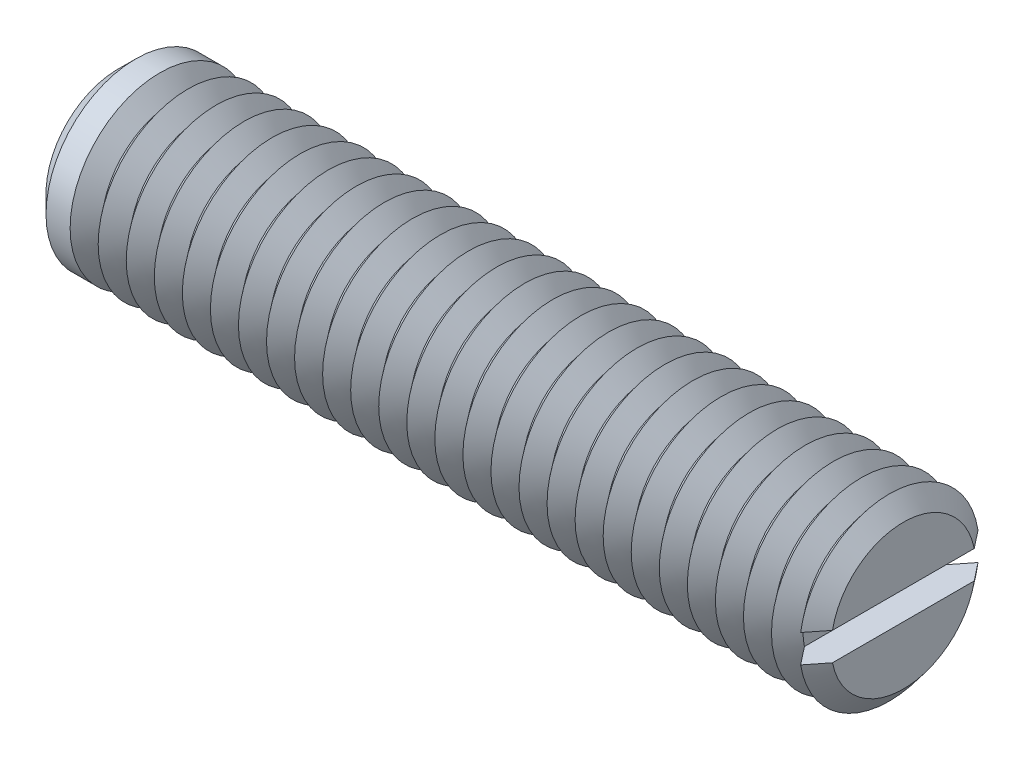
ISO-10303-21;
HEADER;
FILE_DESCRIPTION(('STEP AP214'),'2;1');
FILE_NAME('part.step','',(''),(''),'','','');
FILE_SCHEMA(('AUTOMOTIVE_DESIGN { 1 0 10303 214 1 1 1 1 }'));
ENDSEC;
DATA;
#1=APPLICATION_CONTEXT('core data for automotive mechanical design processes');
#2=APPLICATION_PROTOCOL_DEFINITION('international standard','automotive_design',2000,#1);
#3=PRODUCT_CONTEXT('',#1,'mechanical');
#4=PRODUCT('Part','Part','',(#3));
#5=PRODUCT_RELATED_PRODUCT_CATEGORY('part','',(#4));
#6=PRODUCT_DEFINITION_FORMATION('','',#4);
#7=PRODUCT_DEFINITION_CONTEXT('part definition',#1,'design');
#8=PRODUCT_DEFINITION('design','',#6,#7);
#9=PRODUCT_DEFINITION_SHAPE('','',#8);
#10=(LENGTH_UNIT() NAMED_UNIT(*) SI_UNIT(.MILLI.,.METRE.));
#11=(NAMED_UNIT(*) PLANE_ANGLE_UNIT() SI_UNIT($,.RADIAN.));
#12=(NAMED_UNIT(*) SI_UNIT($,.STERADIAN.) SOLID_ANGLE_UNIT());
#13=UNCERTAINTY_MEASURE_WITH_UNIT(LENGTH_MEASURE(1.E-05),#10,'distance_accuracy_value','');
#14=(GEOMETRIC_REPRESENTATION_CONTEXT(3) GLOBAL_UNCERTAINTY_ASSIGNED_CONTEXT((#13)) GLOBAL_UNIT_ASSIGNED_CONTEXT((#10,
#11,#12)) REPRESENTATION_CONTEXT('',''));
#15=CARTESIAN_POINT('',(0.,0.,0.));
#16=DIRECTION('',(0.,0.,1.));
#17=DIRECTION('',(1.,0.,0.));
#18=AXIS2_PLACEMENT_3D('',#15,#16,#17);
#19=CARTESIAN_POINT('',(16.875,0.,0.));
#20=DIRECTION('',(1.,0.,0.));
#21=DIRECTION('',(0.,0.,-1.));
#22=AXIS2_PLACEMENT_3D('',#19,#20,#21);
#23=CONICAL_SURFACE('',#22,4.,0.895664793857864);
#24=CARTESIAN_POINT('',(16.875,0.,0.));
#25=DIRECTION('',(-1.,0.,0.));
#26=DIRECTION('',(0.,0.,1.));
#27=AXIS2_PLACEMENT_3D('',#24,#25,#26);
#28=CIRCLE('',#27,4.);
#29=CARTESIAN_POINT('',(16.875,-0.625,-3.95087015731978));
#30=VERTEX_POINT('',#29);
#31=CARTESIAN_POINT('',(16.875,-0.625,3.95087015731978));
#32=VERTEX_POINT('',#31);
#33=EDGE_CURVE('E117',#30,#32,#28,.T.);
#34=ORIENTED_EDGE('',*,*,#33,.T.);
#35=CARTESIAN_POINT('',(20.6614902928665,-0.625,-8.70692181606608));
#36=CARTESIAN_POINT('',(20.4148555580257,-0.625,-8.39807520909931));
#37=CARTESIAN_POINT('',(20.1682552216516,-0.625,-8.08920109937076));
#38=CARTESIAN_POINT('',(19.6751408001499,-0.625,-7.47132164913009));
#39=CARTESIAN_POINT('',(19.4286267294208,-0.625,-7.16231629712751));
#40=CARTESIAN_POINT('',(18.9351922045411,-0.625,-6.54345822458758));
#41=CARTESIAN_POINT('',(18.6882721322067,-0.625,-6.23360519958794));
#42=CARTESIAN_POINT('',(18.1947157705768,-0.625,-5.6137348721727));
#43=CARTESIAN_POINT('',(17.9480794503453,-0.625,-5.30371759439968));
#44=CARTESIAN_POINT('',(17.5704817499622,-0.625,-4.8284162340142));
#45=CARTESIAN_POINT('',(17.4393680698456,-0.625,-4.66325315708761));
#46=CARTESIAN_POINT('',(17.1773052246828,-0.625,-4.33279290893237));
#47=CARTESIAN_POINT('',(17.0463560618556,-0.625,-4.16749573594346));
#48=CARTESIAN_POINT('',(16.7846416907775,-0.625,-3.83665276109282));
#49=CARTESIAN_POINT('',(16.6538765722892,-0.625,-3.67110688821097));
#50=CARTESIAN_POINT('',(16.392697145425,-0.625,-3.33975147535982));
#51=CARTESIAN_POINT('',(16.2622828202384,-0.625,-3.17394194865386));
#52=CARTESIAN_POINT('',(16.0022082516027,-0.625,-2.84217045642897));
#53=CARTESIAN_POINT('',(15.8725471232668,-0.625,-2.6762091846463));
#54=CARTESIAN_POINT('',(15.6140928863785,-0.625,-2.34356113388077));
#55=CARTESIAN_POINT('',(15.485299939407,-0.625,-2.17687422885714));
#56=CARTESIAN_POINT('',(15.2934479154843,-0.625,-1.92591523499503));
#57=CARTESIAN_POINT('',(15.2297426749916,-0.625,-1.84213757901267));
#58=CARTESIAN_POINT('',(15.1029724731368,-0.625,-1.67409978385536));
#59=CARTESIAN_POINT('',(15.0399075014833,-0.625,-1.58983965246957));
#60=CARTESIAN_POINT('',(14.9147785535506,-0.625,-1.42061659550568));
#61=CARTESIAN_POINT('',(14.8527142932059,-0.625,-1.33565388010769));
#62=CARTESIAN_POINT('',(14.7301881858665,-0.625,-1.16458302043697));
#63=CARTESIAN_POINT('',(14.6697261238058,-0.625,-1.0784750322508));
#64=CARTESIAN_POINT('',(14.5976838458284,-0.625,-0.972092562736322));
#65=CARTESIAN_POINT('',(14.5847024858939,-0.625,-0.952767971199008));
#66=CARTESIAN_POINT('',(14.5589128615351,-0.625,-0.914003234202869));
#67=CARTESIAN_POINT('',(14.5461046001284,-0.625,-0.894563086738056));
#68=CARTESIAN_POINT('',(14.5079767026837,-0.625,-0.836043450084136));
#69=CARTESIAN_POINT('',(14.4829560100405,-0.625,-0.796767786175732));
#70=CARTESIAN_POINT('',(14.4339776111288,-0.625,-0.717444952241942));
#71=CARTESIAN_POINT('',(14.4100221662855,-0.625,-0.677396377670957));
#72=CARTESIAN_POINT('',(14.3637207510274,-0.625,-0.596377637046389));
#73=CARTESIAN_POINT('',(14.341374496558,-0.625,-0.555407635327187));
#74=CARTESIAN_POINT('',(14.3059952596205,-0.625,-0.485816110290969));
#75=CARTESIAN_POINT('',(14.2923049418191,-0.625,-0.457533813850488));
#76=CARTESIAN_POINT('',(14.266378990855,-0.625,-0.400313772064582));
#77=CARTESIAN_POINT('',(14.2541438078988,-0.625,-0.371375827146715));
#78=CARTESIAN_POINT('',(14.2204304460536,-0.625,-0.283641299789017));
#79=CARTESIAN_POINT('',(14.2017774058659,-0.625,-0.223617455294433));
#80=CARTESIAN_POINT('',(14.1847644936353,-0.625,-0.139102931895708));
#81=CARTESIAN_POINT('',(14.18099555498,-0.625,-0.115688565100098));
#82=CARTESIAN_POINT('',(14.1755004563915,-0.625,-0.0686260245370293));
#83=CARTESIAN_POINT('',(14.1737732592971,-0.625,-0.0449779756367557));
#84=CARTESIAN_POINT('',(14.1724835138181,-0.625,0.00234331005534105));
#85=CARTESIAN_POINT('',(14.172917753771,-0.625,0.0260164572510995));
#86=CARTESIAN_POINT('',(14.1759063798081,-0.625,0.0732268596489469));
#87=CARTESIAN_POINT('',(14.1784611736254,-0.625,0.0967640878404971));
#88=CARTESIAN_POINT('',(14.191400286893,-0.625,0.182271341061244));
#89=CARTESIAN_POINT('',(14.207744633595,-0.625,0.243366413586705));
#90=CARTESIAN_POINT('',(14.2388887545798,-0.625,0.332669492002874));
#91=CARTESIAN_POINT('',(14.2504419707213,-0.625,0.362174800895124));
#92=CARTESIAN_POINT('',(14.2752210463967,-0.625,0.420481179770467));
#93=CARTESIAN_POINT('',(14.2884464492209,-0.625,0.44928243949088));
#94=CARTESIAN_POINT('',(14.3174677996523,-0.625,0.508972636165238));
#95=CARTESIAN_POINT('',(14.3333885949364,-0.625,0.53979966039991));
#96=CARTESIAN_POINT('',(14.3663425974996,-0.625,0.600856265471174));
#97=CARTESIAN_POINT('',(14.3833759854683,-0.625,0.631085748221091));
#98=CARTESIAN_POINT('',(14.4357348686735,-0.625,0.721100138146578));
#99=CARTESIAN_POINT('',(14.4722948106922,-0.625,0.78016344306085));
#100=CARTESIAN_POINT('',(14.5474296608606,-0.625,0.897183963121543));
#101=CARTESIAN_POINT('',(14.5860094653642,-0.625,0.955137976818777));
#102=CARTESIAN_POINT('',(14.6644096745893,-0.625,1.0702065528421));
#103=CARTESIAN_POINT('',(14.7042302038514,-0.625,1.12732103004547));
#104=CARTESIAN_POINT('',(14.7847841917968,-0.625,1.24108525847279));
#105=CARTESIAN_POINT('',(14.8255194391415,-0.625,1.29773373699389));
#106=CARTESIAN_POINT('',(14.9075780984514,-0.625,1.4106117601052));
#107=CARTESIAN_POINT('',(14.9489015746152,-0.625,1.46684125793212));
#108=CARTESIAN_POINT('',(15.0733456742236,-0.625,1.63486189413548));
#109=CARTESIAN_POINT('',(15.1570882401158,-0.625,1.74619171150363));
#110=CARTESIAN_POINT('',(15.3245788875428,-0.625,1.9669036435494));
#111=CARTESIAN_POINT('',(15.4083166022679,-0.625,2.07629366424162));
#112=CARTESIAN_POINT('',(15.5763821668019,-0.625,2.2946201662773));
#113=CARTESIAN_POINT('',(15.6607100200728,-0.625,2.40355664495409));
#114=CARTESIAN_POINT('',(15.9142762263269,-0.625,2.72992534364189));
#115=CARTESIAN_POINT('',(16.0840912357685,-0.625,2.94690900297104));
#116=CARTESIAN_POINT('',(16.4246141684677,-0.625,3.38042406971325));
#117=CARTESIAN_POINT('',(16.595322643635,-0.625,3.59695504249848));
#118=CARTESIAN_POINT('',(16.9371950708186,-0.625,4.02965109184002));
#119=CARTESIAN_POINT('',(17.1083590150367,-0.625,4.24581617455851));
#120=CARTESIAN_POINT('',(17.4504500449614,-0.625,4.67725748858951));
#121=CARTESIAN_POINT('',(17.6213762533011,-0.625,4.89253441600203));
#122=CARTESIAN_POINT('',(17.9634226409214,-0.625,5.32293566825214));
#123=CARTESIAN_POINT('',(18.1345428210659,-0.625,5.53805999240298));
#124=CARTESIAN_POINT('',(18.6480384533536,-0.625,6.18319284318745));
#125=CARTESIAN_POINT('',(18.9906134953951,-0.625,6.61304248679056));
#126=CARTESIAN_POINT('',(19.4438892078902,-0.625,7.18140561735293));
#127=CARTESIAN_POINT('',(19.5544613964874,-0.625,7.32002163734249));
#128=CARTESIAN_POINT('',(19.7756363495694,-0.625,7.59723760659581));
#129=CARTESIAN_POINT('',(19.886239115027,-0.625,7.73583755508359));
#130=CARTESIAN_POINT('',(20.1076076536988,-0.625,8.01319622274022));
#131=CARTESIAN_POINT('',(20.2183734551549,-0.625,8.15195491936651));
#132=CARTESIAN_POINT('',(20.439920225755,-0.625,8.42945184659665));
#133=CARTESIAN_POINT('',(20.5507011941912,-0.625,8.56819007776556));
#134=CARTESIAN_POINT('',(20.6614902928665,-0.625,8.70692181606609));
#135=B_SPLINE_CURVE_WITH_KNOTS('',3,(#35,#36,#37,#38,#39,#40,#41,#42,#43,#44,#45,#46,#47,#48,
#49,#50,#51,#52,#53,#54,#55,#56,#57,#58,#59,#60,#61,#62,#63,#64,#65,#66,#67,#68,#69,#70,#71,#72,
#73,#74,#75,#76,#77,#78,#79,#80,#81,#82,#83,#84,#85,#86,#87,#88,#89,#90,#91,#92,#93,#94,#95,#96,
#97,#98,#99,#100,#101,#102,#103,#104,#105,#106,#107,#108,#109,#110,#111,#112,#113,#114,#115,
#116,#117,#118,#119,#120,#121,#122,#123,#124,#125,#126,#127,#128,#129,#130,#131,#132,#133,#134),
.UNSPECIFIED.,.F.,.F.,(4,2,2,2,2,2,2,2,2,2,2,2,2,2,2,2,2,2,2,2,2,2,2,2,2,2,2,2,2,2,2,2,2,2,2,2,
2,2,2,2,2,2,2,2,2,2,2,2,2,4),(0.,1.18572103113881,2.37158837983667,3.56020338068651,
4.74867342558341,5.38130812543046,6.01395126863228,6.646836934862,7.27969171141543,
7.91151062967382,8.54344406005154,8.85918511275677,9.17492108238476,9.49056578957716,
9.8061679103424,9.8760068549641,9.94584701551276,10.0855382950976,10.2255132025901,
10.3654633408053,10.4596856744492,10.5539370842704,10.741396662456,10.8124690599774,
10.8835053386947,10.9544360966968,11.0253804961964,11.2137597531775,11.3088096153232,
11.403833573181,11.5078935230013,11.6119704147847,11.8202840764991,12.0291284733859,
12.2379939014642,12.4473111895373,12.6566515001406,13.0745694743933,13.4878513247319,
13.9011356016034,14.7277337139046,15.5549232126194,16.3820986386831,17.2067434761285,
18.0313920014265,19.6803778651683,20.2123228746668,20.7442873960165,21.2769292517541,
21.8095515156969),.UNSPECIFIED.);
#136=CARTESIAN_POINT('',(16.25,-0.625,3.1581247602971));
#137=VERTEX_POINT('',#136);
#138=EDGE_CURVE('E109',#137,#32,#135,.T.);
#139=ORIENTED_EDGE('',*,*,#138,.F.);
#140=CARTESIAN_POINT('',(16.25,0.,0.));
#141=DIRECTION('',(-1.,0.,0.));
#142=DIRECTION('',(0.,0.,1.));
#143=AXIS2_PLACEMENT_3D('',#140,#141,#142);
#144=CIRCLE('',#143,3.2193752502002);
#145=CARTESIAN_POINT('',(16.25,-0.625,-3.1581247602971));
#146=VERTEX_POINT('',#145);
#147=EDGE_CURVE('E433',#146,#137,#144,.T.);
#148=ORIENTED_EDGE('',*,*,#147,.F.);
#149=EDGE_CURVE('E58',#30,#146,#135,.T.);
#150=ORIENTED_EDGE('',*,*,#149,.F.);
#151=EDGE_LOOP('',(#34,#139,#148,#150));
#152=FACE_BOUND('',#151,.T.);
#153=ADVANCED_FACE('F37',(#152),#23,.T.);
#154=CARTESIAN_POINT('',(16.875,0.625,3.95087015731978));
#155=VERTEX_POINT('',#154);
#156=CARTESIAN_POINT('',(16.875,0.625,-3.95087015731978));
#157=VERTEX_POINT('',#156);
#158=EDGE_CURVE('E100',#155,#157,#28,.T.);
#159=ORIENTED_EDGE('',*,*,#158,.T.);
#160=CARTESIAN_POINT('',(20.6614902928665,0.625,8.70692181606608));
#161=CARTESIAN_POINT('',(20.4148555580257,0.625,8.39807520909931));
#162=CARTESIAN_POINT('',(20.1682552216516,0.625,8.08920109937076));
#163=CARTESIAN_POINT('',(19.6751408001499,0.625,7.47132164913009));
#164=CARTESIAN_POINT('',(19.4286267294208,0.625,7.16231629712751));
#165=CARTESIAN_POINT('',(18.9351922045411,0.625,6.54345822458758));
#166=CARTESIAN_POINT('',(18.6882721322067,0.625,6.23360519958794));
#167=CARTESIAN_POINT('',(18.1947157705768,0.625,5.6137348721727));
#168=CARTESIAN_POINT('',(17.9480794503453,0.625,5.30371759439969));
#169=CARTESIAN_POINT('',(17.5704817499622,0.625,4.8284162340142));
#170=CARTESIAN_POINT('',(17.4393680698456,0.625,4.66325315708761));
#171=CARTESIAN_POINT('',(17.1773052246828,0.625,4.33279290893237));
#172=CARTESIAN_POINT('',(17.0463560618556,0.625,4.16749573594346));
#173=CARTESIAN_POINT('',(16.7846416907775,0.625,3.83665276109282));
#174=CARTESIAN_POINT('',(16.6538765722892,0.625,3.67110688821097));
#175=CARTESIAN_POINT('',(16.392697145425,0.625,3.33975147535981));
#176=CARTESIAN_POINT('',(16.2622828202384,0.625,3.17394194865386));
#177=CARTESIAN_POINT('',(16.0022082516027,0.625,2.84217045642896));
#178=CARTESIAN_POINT('',(15.8725471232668,0.625,2.67620918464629));
#179=CARTESIAN_POINT('',(15.6140928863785,0.625,2.34356113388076));
#180=CARTESIAN_POINT('',(15.485299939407,0.625,2.17687422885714));
#181=CARTESIAN_POINT('',(15.2934479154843,0.625,1.92591523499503));
#182=CARTESIAN_POINT('',(15.2297426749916,0.625,1.84213757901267));
#183=CARTESIAN_POINT('',(15.1029724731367,0.625,1.67409978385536));
#184=CARTESIAN_POINT('',(15.0399075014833,0.625,1.58983965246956));
#185=CARTESIAN_POINT('',(14.9147785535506,0.625,1.42061659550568));
#186=CARTESIAN_POINT('',(14.8527142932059,0.625,1.33565388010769));
#187=CARTESIAN_POINT('',(14.7301881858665,0.625,1.16458302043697));
#188=CARTESIAN_POINT('',(14.6697261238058,0.625,1.0784750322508));
#189=CARTESIAN_POINT('',(14.5976838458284,0.625,0.972092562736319));
#190=CARTESIAN_POINT('',(14.5847024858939,0.625,0.952767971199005));
#191=CARTESIAN_POINT('',(14.5589128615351,0.625,0.914003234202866));
#192=CARTESIAN_POINT('',(14.5461046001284,0.625,0.894563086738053));
#193=CARTESIAN_POINT('',(14.5079767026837,0.625,0.836043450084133));
#194=CARTESIAN_POINT('',(14.4829560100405,0.625,0.79676778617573));
#195=CARTESIAN_POINT('',(14.4339776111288,0.625,0.717444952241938));
#196=CARTESIAN_POINT('',(14.4100221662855,0.625,0.677396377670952));
#197=CARTESIAN_POINT('',(14.3637207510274,0.625,0.596377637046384));
#198=CARTESIAN_POINT('',(14.3413744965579,0.625,0.555407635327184));
#199=CARTESIAN_POINT('',(14.3059952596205,0.625,0.485816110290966));
#200=CARTESIAN_POINT('',(14.2923049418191,0.625,0.457533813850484));
#201=CARTESIAN_POINT('',(14.266378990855,0.625,0.400313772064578));
#202=CARTESIAN_POINT('',(14.2541438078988,0.625,0.371375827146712));
#203=CARTESIAN_POINT('',(14.2204304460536,0.625,0.283641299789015));
#204=CARTESIAN_POINT('',(14.2017774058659,0.625,0.223617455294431));
#205=CARTESIAN_POINT('',(14.1847644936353,0.625,0.139102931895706));
#206=CARTESIAN_POINT('',(14.18099555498,0.625,0.115688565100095));
#207=CARTESIAN_POINT('',(14.1755004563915,0.625,0.0686260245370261));
#208=CARTESIAN_POINT('',(14.1737732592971,0.625,0.0449779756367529));
#209=CARTESIAN_POINT('',(14.1724835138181,0.625,-0.00234331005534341));
#210=CARTESIAN_POINT('',(14.172917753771,0.625,-0.026016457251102));
#211=CARTESIAN_POINT('',(14.1759063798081,0.625,-0.073226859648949));
#212=CARTESIAN_POINT('',(14.1784611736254,0.625,-0.0967640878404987));
#213=CARTESIAN_POINT('',(14.191400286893,0.625,-0.182271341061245));
#214=CARTESIAN_POINT('',(14.207744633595,0.625,-0.243366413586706));
#215=CARTESIAN_POINT('',(14.2388887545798,0.625,-0.332669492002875));
#216=CARTESIAN_POINT('',(14.2504419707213,0.625,-0.362174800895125));
#217=CARTESIAN_POINT('',(14.2752210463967,0.625,-0.420481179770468));
#218=CARTESIAN_POINT('',(14.2884464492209,0.625,-0.449282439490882));
#219=CARTESIAN_POINT('',(14.3174677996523,0.625,-0.50897263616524));
#220=CARTESIAN_POINT('',(14.3333885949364,0.625,-0.53979966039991));
#221=CARTESIAN_POINT('',(14.3663425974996,0.625,-0.600856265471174));
#222=CARTESIAN_POINT('',(14.3833759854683,0.625,-0.631085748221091));
#223=CARTESIAN_POINT('',(14.4357348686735,0.625,-0.721100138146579));
#224=CARTESIAN_POINT('',(14.4722948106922,0.625,-0.780163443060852));
#225=CARTESIAN_POINT('',(14.5474296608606,0.625,-0.897183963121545));
#226=CARTESIAN_POINT('',(14.5860094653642,0.625,-0.955137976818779));
#227=CARTESIAN_POINT('',(14.6644096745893,0.625,-1.0702065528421));
#228=CARTESIAN_POINT('',(14.7042302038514,0.625,-1.12732103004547));
#229=CARTESIAN_POINT('',(14.7847841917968,0.625,-1.24108525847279));
#230=CARTESIAN_POINT('',(14.8255194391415,0.625,-1.29773373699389));
#231=CARTESIAN_POINT('',(14.9075780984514,0.625,-1.4106117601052));
#232=CARTESIAN_POINT('',(14.9489015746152,0.625,-1.46684125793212));
#233=CARTESIAN_POINT('',(15.0733456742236,0.625,-1.63486189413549));
#234=CARTESIAN_POINT('',(15.1570882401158,0.625,-1.74619171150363));
#235=CARTESIAN_POINT('',(15.3245788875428,0.625,-1.9669036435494));
#236=CARTESIAN_POINT('',(15.4083166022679,0.625,-2.07629366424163));
#237=CARTESIAN_POINT('',(15.5763821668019,0.625,-2.29462016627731));
#238=CARTESIAN_POINT('',(15.6607100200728,0.625,-2.4035566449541));
#239=CARTESIAN_POINT('',(15.9142762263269,0.625,-2.7299253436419));
#240=CARTESIAN_POINT('',(16.0840912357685,0.625,-2.94690900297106));
#241=CARTESIAN_POINT('',(16.4246141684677,0.625,-3.38042406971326));
#242=CARTESIAN_POINT('',(16.595322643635,0.625,-3.59695504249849));
#243=CARTESIAN_POINT('',(16.9371950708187,0.625,-4.02965109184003));
#244=CARTESIAN_POINT('',(17.1083590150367,0.625,-4.24581617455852));
#245=CARTESIAN_POINT('',(17.4504500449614,0.625,-4.67725748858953));
#246=CARTESIAN_POINT('',(17.6213762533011,0.625,-4.89253441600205));
#247=CARTESIAN_POINT('',(17.9634226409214,0.625,-5.32293566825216));
#248=CARTESIAN_POINT('',(18.134542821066,0.625,-5.538059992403));
#249=CARTESIAN_POINT('',(18.6480384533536,0.625,-6.18319284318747));
#250=CARTESIAN_POINT('',(18.9906134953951,0.625,-6.61304248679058));
#251=CARTESIAN_POINT('',(19.4438892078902,0.625,-7.18140561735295));
#252=CARTESIAN_POINT('',(19.5544613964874,0.625,-7.3200216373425));
#253=CARTESIAN_POINT('',(19.7756363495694,0.625,-7.59723760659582));
#254=CARTESIAN_POINT('',(19.886239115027,0.625,-7.7358375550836));
#255=CARTESIAN_POINT('',(20.1076076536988,0.625,-8.01319622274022));
#256=CARTESIAN_POINT('',(20.2183734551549,0.625,-8.15195491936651));
#257=CARTESIAN_POINT('',(20.439920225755,0.625,-8.42945184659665));
#258=CARTESIAN_POINT('',(20.5507011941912,0.625,-8.56819007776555));
#259=CARTESIAN_POINT('',(20.6614902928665,0.625,-8.70692181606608));
#260=B_SPLINE_CURVE_WITH_KNOTS('',3,(#160,#161,#162,#163,#164,#165,#166,#167,#168,#169,#170,
#171,#172,#173,#174,#175,#176,#177,#178,#179,#180,#181,#182,#183,#184,#185,#186,#187,#188,#189,
#190,#191,#192,#193,#194,#195,#196,#197,#198,#199,#200,#201,#202,#203,#204,#205,#206,#207,#208,
#209,#210,#211,#212,#213,#214,#215,#216,#217,#218,#219,#220,#221,#222,#223,#224,#225,#226,#227,
#228,#229,#230,#231,#232,#233,#234,#235,#236,#237,#238,#239,#240,#241,#242,#243,#244,#245,#246,
#247,#248,#249,#250,#251,#252,#253,#254,#255,#256,#257,#258,#259),.UNSPECIFIED.,.F.,.F.,(4,2,2,
2,2,2,2,2,2,2,2,2,2,2,2,2,2,2,2,2,2,2,2,2,2,2,2,2,2,2,2,2,2,2,2,2,2,2,2,2,2,2,2,2,2,2,2,2,2,4),
(0.,1.18572103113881,2.37158837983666,3.5602033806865,4.7486734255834,5.38130812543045,
6.01395126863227,6.646836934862,7.27969171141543,7.91151062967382,8.54344406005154,
8.85918511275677,9.17492108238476,9.49056578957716,9.8061679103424,9.8760068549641,
9.94584701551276,10.0855382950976,10.2255132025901,10.3654633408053,10.4596856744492,
10.5539370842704,10.741396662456,10.8124690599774,10.8835053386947,10.9544360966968,
11.0253804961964,11.2137597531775,11.3088096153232,11.403833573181,11.5078935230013,
11.6119704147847,11.8202840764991,12.0291284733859,12.2379939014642,12.4473111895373,
12.6566515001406,13.0745694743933,13.4878513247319,13.9011356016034,14.7277337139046,
15.5549232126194,16.3820986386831,17.2067434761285,18.0313920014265,19.6803778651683,
20.2123228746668,20.7442873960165,21.2769292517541,21.8095515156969),.UNSPECIFIED.);
#261=CARTESIAN_POINT('',(16.25,0.625,-3.1581247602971));
#262=VERTEX_POINT('',#261);
#263=EDGE_CURVE('E110',#262,#157,#260,.T.);
#264=ORIENTED_EDGE('',*,*,#263,.F.);
#265=CARTESIAN_POINT('',(16.25,0.625,3.1581247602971));
#266=VERTEX_POINT('',#265);
#267=EDGE_CURVE('E103',#266,#262,#144,.T.);
#268=ORIENTED_EDGE('',*,*,#267,.F.);
#269=EDGE_CURVE('E97',#155,#266,#260,.T.);
#270=ORIENTED_EDGE('',*,*,#269,.F.);
#271=EDGE_LOOP('',(#159,#264,#268,#270));
#272=FACE_BOUND('',#271,.T.);
#273=ADVANCED_FACE('F99',(#272),#23,.T.);
#274=CARTESIAN_POINT('',(16.25,0.,0.));
#275=DIRECTION('',(-1.,0.,0.));
#276=DIRECTION('',(0.,0.,1.));
#277=AXIS2_PLACEMENT_3D('',#274,#275,#276);
#278=CONICAL_SURFACE('',#277,3.2193752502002,0.895664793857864);
#279=CARTESIAN_POINT('',(15.625,0.,0.));
#280=DIRECTION('',(-1.,0.,0.));
#281=DIRECTION('',(0.,0.,1.));
#282=AXIS2_PLACEMENT_3D('',#279,#280,#281);
#283=CIRCLE('',#282,4.);
#284=CARTESIAN_POINT('',(15.625,0.,4.));
#285=VERTEX_POINT('',#284);
#286=EDGE_CURVE('E417',#285,#285,#283,.T.);
#287=ORIENTED_EDGE('',*,*,#286,.F.);
#288=EDGE_LOOP('',(#287));
#289=FACE_BOUND('',#288,.T.);
#290=ORIENTED_EDGE('',*,*,#267,.T.);
#291=EDGE_CURVE('E426',#262,#146,#144,.T.);
#292=ORIENTED_EDGE('',*,*,#291,.T.);
#293=ORIENTED_EDGE('',*,*,#147,.T.);
#294=EDGE_CURVE('E424',#137,#266,#144,.T.);
#295=ORIENTED_EDGE('',*,*,#294,.T.);
#296=EDGE_LOOP('',(#290,#292,#293,#295));
#297=FACE_BOUND('',#296,.T.);
#298=ADVANCED_FACE('F167',(#289,#297),#278,.T.);
#299=CARTESIAN_POINT('',(17.5,0.,0.));
#300=DIRECTION('',(1.,0.,0.));
#301=DIRECTION('',(0.,0.,-1.));
#302=AXIS2_PLACEMENT_3D('',#299,#300,#301);
#303=PLANE('',#302);
#304=CARTESIAN_POINT('',(17.5,0.,0.));
#305=DIRECTION('',(-1.,0.,0.));
#306=DIRECTION('',(0.,0.,1.));
#307=AXIS2_PLACEMENT_3D('',#304,#305,#306);
#308=CIRCLE('',#307,3.2193752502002);
#309=CARTESIAN_POINT('',(17.5,0.625,3.1581247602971));
#310=VERTEX_POINT('',#309);
#311=CARTESIAN_POINT('',(17.5,0.625,-3.1581247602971));
#312=VERTEX_POINT('',#311);
#313=EDGE_CURVE('E159',#310,#312,#308,.T.);
#314=ORIENTED_EDGE('',*,*,#313,.F.);
#315=DIRECTION('',(0.,0.,1.));
#316=VECTOR('',#315,1.);
#317=CARTESIAN_POINT('',(17.5,0.625,0.));
#318=LINE('',#317,#316);
#319=EDGE_CURVE('E122',#312,#310,#318,.T.);
#320=ORIENTED_EDGE('',*,*,#319,.F.);
#321=EDGE_LOOP('',(#314,#320));
#322=FACE_BOUND('',#321,.T.);
#323=ADVANCED_FACE('F171',(#322),#303,.T.);
#324=CARTESIAN_POINT('',(17.5,-0.625,-3.1581247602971));
#325=VERTEX_POINT('',#324);
#326=CARTESIAN_POINT('',(17.5,-0.625,3.1581247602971));
#327=VERTEX_POINT('',#326);
#328=EDGE_CURVE('E66',#325,#327,#308,.T.);
#329=ORIENTED_EDGE('',*,*,#328,.F.);
#330=DIRECTION('',(0.,0.,-1.));
#331=VECTOR('',#330,1.);
#332=CARTESIAN_POINT('',(17.5,-0.625,0.));
#333=LINE('',#332,#331);
#334=EDGE_CURVE('E135',#327,#325,#333,.T.);
#335=ORIENTED_EDGE('',*,*,#334,.F.);
#336=EDGE_LOOP('',(#329,#335));
#337=FACE_BOUND('',#336,.T.);
#338=ADVANCED_FACE('F199',(#337),#303,.T.);
#339=CARTESIAN_POINT('',(17.5,0.,0.));
#340=DIRECTION('',(-1.,0.,0.));
#341=DIRECTION('',(0.,0.,1.));
#342=AXIS2_PLACEMENT_3D('',#339,#340,#341);
#343=CONICAL_SURFACE('',#342,3.2193752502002,0.895664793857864);
#344=ORIENTED_EDGE('',*,*,#158,.F.);
#345=CARTESIAN_POINT('',(13.0885097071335,0.625,-8.70692181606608));
#346=CARTESIAN_POINT('',(13.3351444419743,0.625,-8.39807520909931));
#347=CARTESIAN_POINT('',(13.5817447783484,0.625,-8.08920109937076));
#348=CARTESIAN_POINT('',(14.0748591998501,0.625,-7.47132164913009));
#349=CARTESIAN_POINT('',(14.3213732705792,0.625,-7.16231629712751));
#350=CARTESIAN_POINT('',(14.8148077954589,0.625,-6.54345822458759));
#351=CARTESIAN_POINT('',(15.0617278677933,0.625,-6.23360519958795));
#352=CARTESIAN_POINT('',(15.5552842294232,0.625,-5.61373487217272));
#353=CARTESIAN_POINT('',(15.8019205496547,0.625,-5.3037175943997));
#354=CARTESIAN_POINT('',(16.1795182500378,0.625,-4.82841623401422));
#355=CARTESIAN_POINT('',(16.3106319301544,0.625,-4.66325315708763));
#356=CARTESIAN_POINT('',(16.5726947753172,0.625,-4.33279290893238));
#357=CARTESIAN_POINT('',(16.7036439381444,0.625,-4.16749573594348));
#358=CARTESIAN_POINT('',(16.9653583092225,0.625,-3.83665276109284));
#359=CARTESIAN_POINT('',(17.0961234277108,0.625,-3.67110688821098));
#360=CARTESIAN_POINT('',(17.357302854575,0.625,-3.33975147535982));
#361=CARTESIAN_POINT('',(17.4877171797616,0.625,-3.17394194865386));
#362=CARTESIAN_POINT('',(17.7477917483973,0.625,-2.84217045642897));
#363=CARTESIAN_POINT('',(17.8774528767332,0.625,-2.6762091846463));
#364=CARTESIAN_POINT('',(18.1359071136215,0.625,-2.34356113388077));
#365=CARTESIAN_POINT('',(18.264700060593,0.625,-2.17687422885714));
#366=CARTESIAN_POINT('',(18.4565520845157,0.625,-1.92591523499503));
#367=CARTESIAN_POINT('',(18.5202573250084,0.625,-1.84213757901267));
#368=CARTESIAN_POINT('',(18.6470275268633,0.625,-1.67409978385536));
#369=CARTESIAN_POINT('',(18.7100924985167,0.625,-1.58983965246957));
#370=CARTESIAN_POINT('',(18.8352214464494,0.625,-1.42061659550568));
#371=CARTESIAN_POINT('',(18.8972857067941,0.625,-1.3356538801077));
#372=CARTESIAN_POINT('',(19.0198118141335,0.625,-1.16458302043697));
#373=CARTESIAN_POINT('',(19.0802738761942,0.625,-1.0784750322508));
#374=CARTESIAN_POINT('',(19.1523161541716,0.625,-0.97209256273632));
#375=CARTESIAN_POINT('',(19.1652975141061,0.625,-0.952767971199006));
#376=CARTESIAN_POINT('',(19.191087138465,0.625,-0.914003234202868));
#377=CARTESIAN_POINT('',(19.2038953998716,0.625,-0.894563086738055));
#378=CARTESIAN_POINT('',(19.2420232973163,0.625,-0.836043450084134));
#379=CARTESIAN_POINT('',(19.2670439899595,0.625,-0.79676778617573));
#380=CARTESIAN_POINT('',(19.3160223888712,0.625,-0.717444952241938));
#381=CARTESIAN_POINT('',(19.3399778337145,0.625,-0.677396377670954));
#382=CARTESIAN_POINT('',(19.3862792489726,0.625,-0.596377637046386));
#383=CARTESIAN_POINT('',(19.4086255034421,0.625,-0.555407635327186));
#384=CARTESIAN_POINT('',(19.4440047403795,0.625,-0.485816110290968));
#385=CARTESIAN_POINT('',(19.4576950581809,0.625,-0.457533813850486));
#386=CARTESIAN_POINT('',(19.483621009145,0.625,-0.40031377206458));
#387=CARTESIAN_POINT('',(19.4958561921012,0.625,-0.371375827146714));
#388=CARTESIAN_POINT('',(19.5295695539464,0.625,-0.283641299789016));
#389=CARTESIAN_POINT('',(19.5482225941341,0.625,-0.223617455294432));
#390=CARTESIAN_POINT('',(19.5652355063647,0.625,-0.139102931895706));
#391=CARTESIAN_POINT('',(19.56900444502,0.625,-0.115688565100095));
#392=CARTESIAN_POINT('',(19.5744995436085,0.625,-0.0686260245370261));
#393=CARTESIAN_POINT('',(19.5762267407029,0.625,-0.044977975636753));
#394=CARTESIAN_POINT('',(19.5775164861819,0.625,0.00234331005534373));
#395=CARTESIAN_POINT('',(19.577082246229,0.625,0.0260164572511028));
#396=CARTESIAN_POINT('',(19.5740936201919,0.625,0.0732268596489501));
#397=CARTESIAN_POINT('',(19.5715388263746,0.625,0.0967640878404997));
#398=CARTESIAN_POINT('',(19.558599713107,0.625,0.182271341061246));
#399=CARTESIAN_POINT('',(19.542255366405,0.625,0.243366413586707));
#400=CARTESIAN_POINT('',(19.5111112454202,0.625,0.332669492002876));
#401=CARTESIAN_POINT('',(19.4995580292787,0.625,0.362174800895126));
#402=CARTESIAN_POINT('',(19.4747789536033,0.625,0.420481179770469));
#403=CARTESIAN_POINT('',(19.4615535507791,0.625,0.449282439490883));
#404=CARTESIAN_POINT('',(19.4325322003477,0.625,0.508972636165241));
#405=CARTESIAN_POINT('',(19.4166114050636,0.625,0.539799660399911));
#406=CARTESIAN_POINT('',(19.3836574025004,0.625,0.600856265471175));
#407=CARTESIAN_POINT('',(19.3666240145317,0.625,0.631085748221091));
#408=CARTESIAN_POINT('',(19.3142651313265,0.625,0.721100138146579));
#409=CARTESIAN_POINT('',(19.2777051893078,0.625,0.780163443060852));
#410=CARTESIAN_POINT('',(19.2025703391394,0.625,0.897183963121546));
#411=CARTESIAN_POINT('',(19.1639905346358,0.625,0.95513797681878));
#412=CARTESIAN_POINT('',(19.0855903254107,0.625,1.0702065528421));
#413=CARTESIAN_POINT('',(19.0457697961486,0.625,1.12732103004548));
#414=CARTESIAN_POINT('',(18.9652158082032,0.625,1.24108525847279));
#415=CARTESIAN_POINT('',(18.9244805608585,0.625,1.29773373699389));
#416=CARTESIAN_POINT('',(18.8424219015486,0.625,1.4106117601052));
#417=CARTESIAN_POINT('',(18.8010984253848,0.625,1.46684125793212));
#418=CARTESIAN_POINT('',(18.6766543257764,0.625,1.63486189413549));
#419=CARTESIAN_POINT('',(18.5929117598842,0.625,1.74619171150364));
#420=CARTESIAN_POINT('',(18.4254211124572,0.625,1.96690364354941));
#421=CARTESIAN_POINT('',(18.3416833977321,0.625,2.07629366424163));
#422=CARTESIAN_POINT('',(18.1736178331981,0.625,2.29462016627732));
#423=CARTESIAN_POINT('',(18.0892899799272,0.625,2.40355664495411));
#424=CARTESIAN_POINT('',(17.8357237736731,0.625,2.72992534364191));
#425=CARTESIAN_POINT('',(17.6659087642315,0.625,2.94690900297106));
#426=CARTESIAN_POINT('',(17.3253858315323,0.625,3.38042406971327));
#427=CARTESIAN_POINT('',(17.154677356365,0.625,3.5969550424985));
#428=CARTESIAN_POINT('',(16.8128049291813,0.625,4.02965109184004));
#429=CARTESIAN_POINT('',(16.6416409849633,0.625,4.24581617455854));
#430=CARTESIAN_POINT('',(16.2995499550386,0.625,4.67725748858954));
#431=CARTESIAN_POINT('',(16.1286237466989,0.625,4.89253441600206));
#432=CARTESIAN_POINT('',(15.7865773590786,0.625,5.32293566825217));
#433=CARTESIAN_POINT('',(15.615457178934,0.625,5.53805999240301));
#434=CARTESIAN_POINT('',(15.1019615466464,0.625,6.18319284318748));
#435=CARTESIAN_POINT('',(14.7593865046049,0.625,6.6130424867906));
#436=CARTESIAN_POINT('',(14.3061107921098,0.625,7.18140561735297));
#437=CARTESIAN_POINT('',(14.1955386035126,0.625,7.32002163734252));
#438=CARTESIAN_POINT('',(13.9743636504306,0.625,7.59723760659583));
#439=CARTESIAN_POINT('',(13.863760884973,0.625,7.73583755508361));
#440=CARTESIAN_POINT('',(13.6423923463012,0.625,8.01319622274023));
#441=CARTESIAN_POINT('',(13.5316265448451,0.625,8.15195491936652));
#442=CARTESIAN_POINT('',(13.310079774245,0.625,8.42945184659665));
#443=CARTESIAN_POINT('',(13.1992988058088,0.625,8.56819007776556));
#444=CARTESIAN_POINT('',(13.0885097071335,0.625,8.70692181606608));
#445=B_SPLINE_CURVE_WITH_KNOTS('',3,(#345,#346,#347,#348,#349,#350,#351,#352,#353,#354,#355,
#356,#357,#358,#359,#360,#361,#362,#363,#364,#365,#366,#367,#368,#369,#370,#371,#372,#373,#374,
#375,#376,#377,#378,#379,#380,#381,#382,#383,#384,#385,#386,#387,#388,#389,#390,#391,#392,#393,
#394,#395,#396,#397,#398,#399,#400,#401,#402,#403,#404,#405,#406,#407,#408,#409,#410,#411,#412,
#413,#414,#415,#416,#417,#418,#419,#420,#421,#422,#423,#424,#425,#426,#427,#428,#429,#430,#431,
#432,#433,#434,#435,#436,#437,#438,#439,#440,#441,#442,#443,#444),.UNSPECIFIED.,.F.,.F.,(4,2,2,
2,2,2,2,2,2,2,2,2,2,2,2,2,2,2,2,2,2,2,2,2,2,2,2,2,2,2,2,2,2,2,2,2,2,2,2,2,2,2,2,2,2,2,2,2,2,4),
(0.,1.18572103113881,2.37158837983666,3.56020338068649,4.74867342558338,5.38130812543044,
6.01395126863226,6.64683693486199,7.27969171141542,7.91151062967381,8.54344406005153,
8.85918511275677,9.17492108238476,9.49056578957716,9.8061679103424,9.8760068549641,
9.94584701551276,10.0855382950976,10.2255132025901,10.3654633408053,10.4596856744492,
10.5539370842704,10.741396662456,10.8124690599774,10.8835053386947,10.9544360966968,
11.0253804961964,11.2137597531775,11.3088096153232,11.403833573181,11.5078935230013,
11.6119704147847,11.8202840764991,12.0291284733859,12.2379939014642,12.4473111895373,
12.6566515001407,13.0745694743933,13.4878513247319,13.9011356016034,14.7277337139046,
15.5549232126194,16.3820986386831,17.2067434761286,18.0313920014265,19.6803778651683,
20.2123228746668,20.7442873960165,21.2769292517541,21.8095515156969),.UNSPECIFIED.);
#446=EDGE_CURVE('E41',#310,#155,#445,.T.);
#447=ORIENTED_EDGE('',*,*,#446,.F.);
#448=ORIENTED_EDGE('',*,*,#313,.T.);
#449=EDGE_CURVE('E11',#157,#312,#445,.T.);
#450=ORIENTED_EDGE('',*,*,#449,.F.);
#451=EDGE_LOOP('',(#344,#447,#448,#450));
#452=FACE_BOUND('',#451,.T.);
#453=ADVANCED_FACE('F114',(#452),#343,.T.);
#454=CARTESIAN_POINT('',(17.5,0.625,-6.));
#455=DIRECTION('',(0.,1.,0.));
#456=DIRECTION('',(0.,0.,1.));
#457=AXIS2_PLACEMENT_3D('',#454,#455,#456);
#458=PLANE('',#457);
#459=ORIENTED_EDGE('',*,*,#446,.T.);
#460=ORIENTED_EDGE('',*,*,#269,.T.);
#461=DIRECTION('',(0.,0.,1.));
#462=VECTOR('',#461,1.);
#463=CARTESIAN_POINT('',(16.25,0.625,-6.));
#464=LINE('',#463,#462);
#465=EDGE_CURVE('E144',#262,#266,#464,.T.);
#466=ORIENTED_EDGE('',*,*,#465,.F.);
#467=ORIENTED_EDGE('',*,*,#263,.T.);
#468=ORIENTED_EDGE('',*,*,#449,.T.);
#469=ORIENTED_EDGE('',*,*,#319,.T.);
#470=EDGE_LOOP('',(#459,#460,#466,#467,#468,#469));
#471=FACE_BOUND('',#470,.T.);
#472=ADVANCED_FACE('F120',(#471),#458,.F.);
#473=ORIENTED_EDGE('',*,*,#33,.F.);
#474=CARTESIAN_POINT('',(13.0885097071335,-0.625,8.70692181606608));
#475=CARTESIAN_POINT('',(13.3351444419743,-0.625,8.39807520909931));
#476=CARTESIAN_POINT('',(13.5817447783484,-0.625,8.08920109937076));
#477=CARTESIAN_POINT('',(14.07485919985,-0.625,7.47132164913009));
#478=CARTESIAN_POINT('',(14.3213732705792,-0.625,7.16231629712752));
#479=CARTESIAN_POINT('',(14.8148077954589,-0.625,6.54345822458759));
#480=CARTESIAN_POINT('',(15.0617278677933,-0.625,6.23360519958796));
#481=CARTESIAN_POINT('',(15.5552842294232,-0.625,5.61373487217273));
#482=CARTESIAN_POINT('',(15.8019205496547,-0.625,5.30371759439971));
#483=CARTESIAN_POINT('',(16.1795182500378,-0.625,4.82841623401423));
#484=CARTESIAN_POINT('',(16.3106319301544,-0.625,4.66325315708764));
#485=CARTESIAN_POINT('',(16.5726947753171,-0.625,4.33279290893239));
#486=CARTESIAN_POINT('',(16.7036439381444,-0.625,4.16749573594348));
#487=CARTESIAN_POINT('',(16.9653583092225,-0.625,3.83665276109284));
#488=CARTESIAN_POINT('',(17.0961234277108,-0.625,3.67110688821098));
#489=CARTESIAN_POINT('',(17.357302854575,-0.625,3.33975147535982));
#490=CARTESIAN_POINT('',(17.4877171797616,-0.625,3.17394194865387));
#491=CARTESIAN_POINT('',(17.7477917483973,-0.625,2.84217045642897));
#492=CARTESIAN_POINT('',(17.8774528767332,-0.625,2.6762091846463));
#493=CARTESIAN_POINT('',(18.1359071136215,-0.625,2.34356113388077));
#494=CARTESIAN_POINT('',(18.264700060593,-0.625,2.17687422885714));
#495=CARTESIAN_POINT('',(18.4565520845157,-0.625,1.92591523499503));
#496=CARTESIAN_POINT('',(18.5202573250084,-0.625,1.84213757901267));
#497=CARTESIAN_POINT('',(18.6470275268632,-0.625,1.67409978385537));
#498=CARTESIAN_POINT('',(18.7100924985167,-0.625,1.58983965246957));
#499=CARTESIAN_POINT('',(18.8352214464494,-0.625,1.42061659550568));
#500=CARTESIAN_POINT('',(18.8972857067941,-0.625,1.3356538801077));
#501=CARTESIAN_POINT('',(19.0198118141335,-0.625,1.16458302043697));
#502=CARTESIAN_POINT('',(19.0802738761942,-0.625,1.0784750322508));
#503=CARTESIAN_POINT('',(19.1523161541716,-0.625,0.97209256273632));
#504=CARTESIAN_POINT('',(19.1652975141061,-0.625,0.952767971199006));
#505=CARTESIAN_POINT('',(19.191087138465,-0.625,0.914003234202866));
#506=CARTESIAN_POINT('',(19.2038953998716,-0.625,0.894563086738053));
#507=CARTESIAN_POINT('',(19.2420232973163,-0.625,0.836043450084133));
#508=CARTESIAN_POINT('',(19.2670439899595,-0.625,0.796767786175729));
#509=CARTESIAN_POINT('',(19.3160223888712,-0.625,0.717444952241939));
#510=CARTESIAN_POINT('',(19.3399778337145,-0.625,0.677396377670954));
#511=CARTESIAN_POINT('',(19.3862792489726,-0.625,0.596377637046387));
#512=CARTESIAN_POINT('',(19.4086255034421,-0.625,0.555407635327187));
#513=CARTESIAN_POINT('',(19.4440047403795,-0.625,0.485816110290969));
#514=CARTESIAN_POINT('',(19.4576950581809,-0.625,0.457533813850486));
#515=CARTESIAN_POINT('',(19.483621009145,-0.625,0.400313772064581));
#516=CARTESIAN_POINT('',(19.4958561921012,-0.625,0.371375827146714));
#517=CARTESIAN_POINT('',(19.5295695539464,-0.625,0.283641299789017));
#518=CARTESIAN_POINT('',(19.5482225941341,-0.625,0.223617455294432));
#519=CARTESIAN_POINT('',(19.5652355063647,-0.625,0.139102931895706));
#520=CARTESIAN_POINT('',(19.56900444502,-0.625,0.115688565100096));
#521=CARTESIAN_POINT('',(19.5744995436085,-0.625,0.0686260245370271));
#522=CARTESIAN_POINT('',(19.5762267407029,-0.625,0.0449779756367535));
#523=CARTESIAN_POINT('',(19.5775164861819,-0.625,-0.00234331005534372));
#524=CARTESIAN_POINT('',(19.577082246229,-0.625,-0.0260164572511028));
#525=CARTESIAN_POINT('',(19.5740936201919,-0.625,-0.0732268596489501));
#526=CARTESIAN_POINT('',(19.5715388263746,-0.625,-0.0967640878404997));
#527=CARTESIAN_POINT('',(19.558599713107,-0.625,-0.182271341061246));
#528=CARTESIAN_POINT('',(19.542255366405,-0.625,-0.243366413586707));
#529=CARTESIAN_POINT('',(19.5111112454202,-0.625,-0.332669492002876));
#530=CARTESIAN_POINT('',(19.4995580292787,-0.625,-0.362174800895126));
#531=CARTESIAN_POINT('',(19.4747789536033,-0.625,-0.420481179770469));
#532=CARTESIAN_POINT('',(19.4615535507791,-0.625,-0.449282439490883));
#533=CARTESIAN_POINT('',(19.4325322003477,-0.625,-0.508972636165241));
#534=CARTESIAN_POINT('',(19.4166114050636,-0.625,-0.539799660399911));
#535=CARTESIAN_POINT('',(19.3836574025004,-0.625,-0.600856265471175));
#536=CARTESIAN_POINT('',(19.3666240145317,-0.625,-0.631085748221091));
#537=CARTESIAN_POINT('',(19.3142651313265,-0.625,-0.721100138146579));
#538=CARTESIAN_POINT('',(19.2777051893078,-0.625,-0.780163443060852));
#539=CARTESIAN_POINT('',(19.2025703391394,-0.625,-0.897183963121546));
#540=CARTESIAN_POINT('',(19.1639905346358,-0.625,-0.95513797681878));
#541=CARTESIAN_POINT('',(19.0855903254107,-0.625,-1.0702065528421));
#542=CARTESIAN_POINT('',(19.0457697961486,-0.625,-1.12732103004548));
#543=CARTESIAN_POINT('',(18.9652158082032,-0.625,-1.24108525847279));
#544=CARTESIAN_POINT('',(18.9244805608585,-0.625,-1.29773373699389));
#545=CARTESIAN_POINT('',(18.8424219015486,-0.625,-1.4106117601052));
#546=CARTESIAN_POINT('',(18.8010984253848,-0.625,-1.46684125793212));
#547=CARTESIAN_POINT('',(18.6766543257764,-0.625,-1.63486189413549));
#548=CARTESIAN_POINT('',(18.5929117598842,-0.625,-1.74619171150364));
#549=CARTESIAN_POINT('',(18.4254211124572,-0.625,-1.96690364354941));
#550=CARTESIAN_POINT('',(18.3416833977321,-0.625,-2.07629366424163));
#551=CARTESIAN_POINT('',(18.1736178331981,-0.625,-2.29462016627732));
#552=CARTESIAN_POINT('',(18.0892899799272,-0.625,-2.40355664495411));
#553=CARTESIAN_POINT('',(17.8357237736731,-0.625,-2.72992534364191));
#554=CARTESIAN_POINT('',(17.6659087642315,-0.625,-2.94690900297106));
#555=CARTESIAN_POINT('',(17.3253858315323,-0.625,-3.38042406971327));
#556=CARTESIAN_POINT('',(17.154677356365,-0.625,-3.5969550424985));
#557=CARTESIAN_POINT('',(16.8128049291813,-0.625,-4.02965109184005));
#558=CARTESIAN_POINT('',(16.6416409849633,-0.625,-4.24581617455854));
#559=CARTESIAN_POINT('',(16.2995499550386,-0.625,-4.67725748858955));
#560=CARTESIAN_POINT('',(16.1286237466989,-0.625,-4.89253441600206));
#561=CARTESIAN_POINT('',(15.7865773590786,-0.625,-5.32293566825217));
#562=CARTESIAN_POINT('',(15.615457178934,-0.625,-5.53805999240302));
#563=CARTESIAN_POINT('',(15.1019615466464,-0.625,-6.18319284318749));
#564=CARTESIAN_POINT('',(14.7593865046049,-0.625,-6.6130424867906));
#565=CARTESIAN_POINT('',(14.3061107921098,-0.625,-7.18140561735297));
#566=CARTESIAN_POINT('',(14.1955386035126,-0.625,-7.32002163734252));
#567=CARTESIAN_POINT('',(13.9743636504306,-0.625,-7.59723760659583));
#568=CARTESIAN_POINT('',(13.863760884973,-0.625,-7.73583755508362));
#569=CARTESIAN_POINT('',(13.6423923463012,-0.625,-8.01319622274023));
#570=CARTESIAN_POINT('',(13.5316265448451,-0.625,-8.15195491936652));
#571=CARTESIAN_POINT('',(13.310079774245,-0.625,-8.42945184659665));
#572=CARTESIAN_POINT('',(13.1992988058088,-0.625,-8.56819007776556));
#573=CARTESIAN_POINT('',(13.0885097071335,-0.625,-8.70692181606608));
#574=B_SPLINE_CURVE_WITH_KNOTS('',3,(#474,#475,#476,#477,#478,#479,#480,#481,#482,#483,#484,
#485,#486,#487,#488,#489,#490,#491,#492,#493,#494,#495,#496,#497,#498,#499,#500,#501,#502,#503,
#504,#505,#506,#507,#508,#509,#510,#511,#512,#513,#514,#515,#516,#517,#518,#519,#520,#521,#522,
#523,#524,#525,#526,#527,#528,#529,#530,#531,#532,#533,#534,#535,#536,#537,#538,#539,#540,#541,
#542,#543,#544,#545,#546,#547,#548,#549,#550,#551,#552,#553,#554,#555,#556,#557,#558,#559,#560,
#561,#562,#563,#564,#565,#566,#567,#568,#569,#570,#571,#572,#573),.UNSPECIFIED.,.F.,.F.,(4,2,2,
2,2,2,2,2,2,2,2,2,2,2,2,2,2,2,2,2,2,2,2,2,2,2,2,2,2,2,2,2,2,2,2,2,2,2,2,2,2,2,2,2,2,2,2,2,2,4),
(0.,1.1857210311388,2.37158837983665,3.56020338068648,4.74867342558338,5.38130812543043,
6.01395126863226,6.64683693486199,7.27969171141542,7.91151062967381,8.54344406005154,
8.85918511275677,9.17492108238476,9.49056578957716,9.8061679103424,9.8760068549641,
9.94584701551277,10.0855382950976,10.2255132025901,10.3654633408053,10.4596856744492,
10.5539370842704,10.741396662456,10.8124690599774,10.8835053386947,10.9544360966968,
11.0253804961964,11.2137597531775,11.3088096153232,11.403833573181,11.5078935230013,
11.6119704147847,11.8202840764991,12.0291284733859,12.2379939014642,12.4473111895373,
12.6566515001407,13.0745694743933,13.4878513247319,13.9011356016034,14.7277337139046,
15.5549232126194,16.3820986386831,17.2067434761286,18.0313920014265,19.6803778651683,
20.2123228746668,20.7442873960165,21.2769292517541,21.8095515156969),.UNSPECIFIED.);
#575=EDGE_CURVE('E151',#325,#30,#574,.T.);
#576=ORIENTED_EDGE('',*,*,#575,.F.);
#577=ORIENTED_EDGE('',*,*,#328,.T.);
#578=EDGE_CURVE('E147',#32,#327,#574,.T.);
#579=ORIENTED_EDGE('',*,*,#578,.F.);
#580=EDGE_LOOP('',(#473,#576,#577,#579));
#581=FACE_BOUND('',#580,.T.);
#582=ADVANCED_FACE('F163',(#581),#343,.T.);
#583=CARTESIAN_POINT('',(17.5,-0.625,-6.));
#584=DIRECTION('',(0.,-1.,0.));
#585=DIRECTION('',(0.,0.,-1.));
#586=AXIS2_PLACEMENT_3D('',#583,#584,#585);
#587=PLANE('',#586);
#588=ORIENTED_EDGE('',*,*,#575,.T.);
#589=ORIENTED_EDGE('',*,*,#149,.T.);
#590=DIRECTION('',(0.,0.,1.));
#591=VECTOR('',#590,1.);
#592=CARTESIAN_POINT('',(16.25,-0.625,-6.));
#593=LINE('',#592,#591);
#594=EDGE_CURVE('E143',#146,#137,#593,.T.);
#595=ORIENTED_EDGE('',*,*,#594,.T.);
#596=ORIENTED_EDGE('',*,*,#138,.T.);
#597=ORIENTED_EDGE('',*,*,#578,.T.);
#598=ORIENTED_EDGE('',*,*,#334,.T.);
#599=EDGE_LOOP('',(#588,#589,#595,#596,#597,#598));
#600=FACE_BOUND('',#599,.T.);
#601=ADVANCED_FACE('F160',(#600),#587,.F.);
#602=CARTESIAN_POINT('',(16.25,0.625,-6.));
#603=DIRECTION('',(-1.,0.,0.));
#604=DIRECTION('',(0.,0.,1.));
#605=AXIS2_PLACEMENT_3D('',#602,#603,#604);
#606=PLANE('',#605);
#607=ORIENTED_EDGE('',*,*,#594,.F.);
#608=ORIENTED_EDGE('',*,*,#291,.F.);
#609=ORIENTED_EDGE('',*,*,#465,.T.);
#610=ORIENTED_EDGE('',*,*,#294,.F.);
#611=EDGE_LOOP('',(#607,#608,#609,#610));
#612=FACE_BOUND('',#611,.T.);
#613=ADVANCED_FACE('F437',(#612),#606,.F.);
#614=CARTESIAN_POINT('',(15.,0.,0.));
#615=DIRECTION('',(-1.,0.,0.));
#616=DIRECTION('',(0.,0.,1.));
#617=AXIS2_PLACEMENT_3D('',#614,#615,#616);
#618=CONICAL_SURFACE('',#617,3.2193752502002,0.895664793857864);
#619=CARTESIAN_POINT('',(14.375,0.,0.));
#620=DIRECTION('',(-1.,0.,0.));
#621=DIRECTION('',(0.,0.,1.));
#622=AXIS2_PLACEMENT_3D('',#619,#620,#621);
#623=CIRCLE('',#622,4.);
#624=CARTESIAN_POINT('',(14.375,0.,4.));
#625=VERTEX_POINT('',#624);
#626=EDGE_CURVE('E409',#625,#625,#623,.T.);
#627=ORIENTED_EDGE('',*,*,#626,.F.);
#628=EDGE_LOOP('',(#627));
#629=FACE_BOUND('',#628,.T.);
#630=CARTESIAN_POINT('',(15.,0.,0.));
#631=DIRECTION('',(-1.,0.,0.));
#632=DIRECTION('',(0.,0.,1.));
#633=AXIS2_PLACEMENT_3D('',#630,#631,#632);
#634=CIRCLE('',#633,3.2193752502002);
#635=CARTESIAN_POINT('',(15.,0.,3.2193752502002));
#636=VERTEX_POINT('',#635);
#637=EDGE_CURVE('E421',#636,#636,#634,.T.);
#638=ORIENTED_EDGE('',*,*,#637,.T.);
#639=EDGE_LOOP('',(#638));
#640=FACE_BOUND('',#639,.T.);
#641=ADVANCED_FACE('F176',(#629,#640),#618,.T.);
#642=CARTESIAN_POINT('',(15.625,0.,0.));
#643=DIRECTION('',(1.,0.,0.));
#644=DIRECTION('',(0.,0.,-1.));
#645=AXIS2_PLACEMENT_3D('',#642,#643,#644);
#646=CONICAL_SURFACE('',#645,4.,0.895664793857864);
#647=ORIENTED_EDGE('',*,*,#637,.F.);
#648=EDGE_LOOP('',(#647));
#649=FACE_BOUND('',#648,.T.);
#650=ORIENTED_EDGE('',*,*,#286,.T.);
#651=EDGE_LOOP('',(#650));
#652=FACE_BOUND('',#651,.T.);
#653=ADVANCED_FACE('F443',(#649,#652),#646,.T.);
#654=CARTESIAN_POINT('',(13.75,0.,0.));
#655=DIRECTION('',(-1.,0.,0.));
#656=DIRECTION('',(0.,0.,1.));
#657=AXIS2_PLACEMENT_3D('',#654,#655,#656);
#658=CONICAL_SURFACE('',#657,3.2193752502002,0.895664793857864);
#659=CARTESIAN_POINT('',(13.125,0.,0.));
#660=DIRECTION('',(-1.,0.,0.));
#661=DIRECTION('',(0.,0.,1.));
#662=AXIS2_PLACEMENT_3D('',#659,#660,#661);
#663=CIRCLE('',#662,4.);
#664=CARTESIAN_POINT('',(13.125,0.,4.));
#665=VERTEX_POINT('',#664);
#666=EDGE_CURVE('E401',#665,#665,#663,.T.);
#667=ORIENTED_EDGE('',*,*,#666,.F.);
#668=EDGE_LOOP('',(#667));
#669=FACE_BOUND('',#668,.T.);
#670=CARTESIAN_POINT('',(13.75,0.,0.));
#671=DIRECTION('',(-1.,0.,0.));
#672=DIRECTION('',(0.,0.,1.));
#673=AXIS2_PLACEMENT_3D('',#670,#671,#672);
#674=CIRCLE('',#673,3.2193752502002);
#675=CARTESIAN_POINT('',(13.75,0.,3.2193752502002));
#676=VERTEX_POINT('',#675);
#677=EDGE_CURVE('E413',#676,#676,#674,.T.);
#678=ORIENTED_EDGE('',*,*,#677,.T.);
#679=EDGE_LOOP('',(#678));
#680=FACE_BOUND('',#679,.T.);
#681=ADVANCED_FACE('F507',(#669,#680),#658,.T.);
#682=CARTESIAN_POINT('',(14.375,0.,0.));
#683=DIRECTION('',(1.,0.,0.));
#684=DIRECTION('',(0.,0.,-1.));
#685=AXIS2_PLACEMENT_3D('',#682,#683,#684);
#686=CONICAL_SURFACE('',#685,4.,0.895664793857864);
#687=ORIENTED_EDGE('',*,*,#677,.F.);
#688=EDGE_LOOP('',(#687));
#689=FACE_BOUND('',#688,.T.);
#690=ORIENTED_EDGE('',*,*,#626,.T.);
#691=EDGE_LOOP('',(#690));
#692=FACE_BOUND('',#691,.T.);
#693=ADVANCED_FACE('F516',(#689,#692),#686,.T.);
#694=CARTESIAN_POINT('',(12.5,0.,0.));
#695=DIRECTION('',(-1.,0.,0.));
#696=DIRECTION('',(0.,0.,1.));
#697=AXIS2_PLACEMENT_3D('',#694,#695,#696);
#698=CONICAL_SURFACE('',#697,3.2193752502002,0.895664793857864);
#699=CARTESIAN_POINT('',(11.875,0.,0.));
#700=DIRECTION('',(-1.,0.,0.));
#701=DIRECTION('',(0.,0.,1.));
#702=AXIS2_PLACEMENT_3D('',#699,#700,#701);
#703=CIRCLE('',#702,4.);
#704=CARTESIAN_POINT('',(11.875,0.,4.));
#705=VERTEX_POINT('',#704);
#706=EDGE_CURVE('E394',#705,#705,#703,.T.);
#707=ORIENTED_EDGE('',*,*,#706,.F.);
#708=EDGE_LOOP('',(#707));
#709=FACE_BOUND('',#708,.T.);
#710=CARTESIAN_POINT('',(12.5,0.,0.));
#711=DIRECTION('',(-1.,0.,0.));
#712=DIRECTION('',(0.,0.,1.));
#713=AXIS2_PLACEMENT_3D('',#710,#711,#712);
#714=CIRCLE('',#713,3.2193752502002);
#715=CARTESIAN_POINT('',(12.5,0.,3.2193752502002));
#716=VERTEX_POINT('',#715);
#717=EDGE_CURVE('E405',#716,#716,#714,.T.);
#718=ORIENTED_EDGE('',*,*,#717,.T.);
#719=EDGE_LOOP('',(#718));
#720=FACE_BOUND('',#719,.T.);
#721=ADVANCED_FACE('F526',(#709,#720),#698,.T.);
#722=CARTESIAN_POINT('',(13.125,0.,0.));
#723=DIRECTION('',(1.,0.,0.));
#724=DIRECTION('',(0.,0.,-1.));
#725=AXIS2_PLACEMENT_3D('',#722,#723,#724);
#726=CONICAL_SURFACE('',#725,4.,0.895664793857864);
#727=ORIENTED_EDGE('',*,*,#717,.F.);
#728=EDGE_LOOP('',(#727));
#729=FACE_BOUND('',#728,.T.);
#730=ORIENTED_EDGE('',*,*,#666,.T.);
#731=EDGE_LOOP('',(#730));
#732=FACE_BOUND('',#731,.T.);
#733=ADVANCED_FACE('F536',(#729,#732),#726,.T.);
#734=CARTESIAN_POINT('',(11.25,0.,0.));
#735=DIRECTION('',(-1.,0.,0.));
#736=DIRECTION('',(0.,0.,1.));
#737=AXIS2_PLACEMENT_3D('',#734,#735,#736);
#738=CONICAL_SURFACE('',#737,3.2193752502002,0.895664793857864);
#739=CARTESIAN_POINT('',(10.625,0.,0.));
#740=DIRECTION('',(-1.,0.,0.));
#741=DIRECTION('',(0.,0.,1.));
#742=AXIS2_PLACEMENT_3D('',#739,#740,#741);
#743=CIRCLE('',#742,4.);
#744=CARTESIAN_POINT('',(10.625,0.,4.));
#745=VERTEX_POINT('',#744);
#746=EDGE_CURVE('E387',#745,#745,#743,.T.);
#747=ORIENTED_EDGE('',*,*,#746,.F.);
#748=EDGE_LOOP('',(#747));
#749=FACE_BOUND('',#748,.T.);
#750=CARTESIAN_POINT('',(11.25,0.,0.));
#751=DIRECTION('',(-1.,0.,0.));
#752=DIRECTION('',(0.,0.,1.));
#753=AXIS2_PLACEMENT_3D('',#750,#751,#752);
#754=CIRCLE('',#753,3.2193752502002);
#755=CARTESIAN_POINT('',(11.25,0.,3.2193752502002));
#756=VERTEX_POINT('',#755);
#757=EDGE_CURVE('E398',#756,#756,#754,.T.);
#758=ORIENTED_EDGE('',*,*,#757,.T.);
#759=EDGE_LOOP('',(#758));
#760=FACE_BOUND('',#759,.T.);
#761=ADVANCED_FACE('F546',(#749,#760),#738,.T.);
#762=CARTESIAN_POINT('',(11.875,0.,0.));
#763=DIRECTION('',(1.,0.,0.));
#764=DIRECTION('',(0.,0.,-1.));
#765=AXIS2_PLACEMENT_3D('',#762,#763,#764);
#766=CONICAL_SURFACE('',#765,4.,0.895664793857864);
#767=ORIENTED_EDGE('',*,*,#757,.F.);
#768=EDGE_LOOP('',(#767));
#769=FACE_BOUND('',#768,.T.);
#770=ORIENTED_EDGE('',*,*,#706,.T.);
#771=EDGE_LOOP('',(#770));
#772=FACE_BOUND('',#771,.T.);
#773=ADVANCED_FACE('F556',(#769,#772),#766,.T.);
#774=CARTESIAN_POINT('',(10.,0.,0.));
#775=DIRECTION('',(-1.,0.,0.));
#776=DIRECTION('',(0.,0.,1.));
#777=AXIS2_PLACEMENT_3D('',#774,#775,#776);
#778=CONICAL_SURFACE('',#777,3.2193752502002,0.895664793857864);
#779=CARTESIAN_POINT('',(9.375,0.,0.));
#780=DIRECTION('',(-1.,0.,0.));
#781=DIRECTION('',(0.,0.,1.));
#782=AXIS2_PLACEMENT_3D('',#779,#780,#781);
#783=CIRCLE('',#782,4.);
#784=CARTESIAN_POINT('',(9.375,0.,4.));
#785=VERTEX_POINT('',#784);
#786=EDGE_CURVE('E379',#785,#785,#783,.T.);
#787=ORIENTED_EDGE('',*,*,#786,.F.);
#788=EDGE_LOOP('',(#787));
#789=FACE_BOUND('',#788,.T.);
#790=CARTESIAN_POINT('',(10.,0.,0.));
#791=DIRECTION('',(-1.,0.,0.));
#792=DIRECTION('',(0.,0.,1.));
#793=AXIS2_PLACEMENT_3D('',#790,#791,#792);
#794=CIRCLE('',#793,3.2193752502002);
#795=CARTESIAN_POINT('',(10.,0.,3.2193752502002));
#796=VERTEX_POINT('',#795);
#797=EDGE_CURVE('E391',#796,#796,#794,.T.);
#798=ORIENTED_EDGE('',*,*,#797,.T.);
#799=EDGE_LOOP('',(#798));
#800=FACE_BOUND('',#799,.T.);
#801=ADVANCED_FACE('F566',(#789,#800),#778,.T.);
#802=CARTESIAN_POINT('',(10.625,0.,0.));
#803=DIRECTION('',(1.,0.,0.));
#804=DIRECTION('',(0.,0.,-1.));
#805=AXIS2_PLACEMENT_3D('',#802,#803,#804);
#806=CONICAL_SURFACE('',#805,4.,0.895664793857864);
#807=ORIENTED_EDGE('',*,*,#797,.F.);
#808=EDGE_LOOP('',(#807));
#809=FACE_BOUND('',#808,.T.);
#810=ORIENTED_EDGE('',*,*,#746,.T.);
#811=EDGE_LOOP('',(#810));
#812=FACE_BOUND('',#811,.T.);
#813=ADVANCED_FACE('F576',(#809,#812),#806,.T.);
#814=CARTESIAN_POINT('',(8.75,0.,0.));
#815=DIRECTION('',(-1.,0.,0.));
#816=DIRECTION('',(0.,0.,1.));
#817=AXIS2_PLACEMENT_3D('',#814,#815,#816);
#818=CONICAL_SURFACE('',#817,3.2193752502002,0.895664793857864);
#819=CARTESIAN_POINT('',(8.125,0.,0.));
#820=DIRECTION('',(-1.,0.,0.));
#821=DIRECTION('',(0.,0.,1.));
#822=AXIS2_PLACEMENT_3D('',#819,#820,#821);
#823=CIRCLE('',#822,4.);
#824=CARTESIAN_POINT('',(8.125,0.,4.));
#825=VERTEX_POINT('',#824);
#826=EDGE_CURVE('E371',#825,#825,#823,.T.);
#827=ORIENTED_EDGE('',*,*,#826,.F.);
#828=EDGE_LOOP('',(#827));
#829=FACE_BOUND('',#828,.T.);
#830=CARTESIAN_POINT('',(8.75,0.,0.));
#831=DIRECTION('',(-1.,0.,0.));
#832=DIRECTION('',(0.,0.,1.));
#833=AXIS2_PLACEMENT_3D('',#830,#831,#832);
#834=CIRCLE('',#833,3.2193752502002);
#835=CARTESIAN_POINT('',(8.75,0.,3.2193752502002));
#836=VERTEX_POINT('',#835);
#837=EDGE_CURVE('E383',#836,#836,#834,.T.);
#838=ORIENTED_EDGE('',*,*,#837,.T.);
#839=EDGE_LOOP('',(#838));
#840=FACE_BOUND('',#839,.T.);
#841=ADVANCED_FACE('F586',(#829,#840),#818,.T.);
#842=CARTESIAN_POINT('',(9.375,0.,0.));
#843=DIRECTION('',(1.,0.,0.));
#844=DIRECTION('',(0.,0.,-1.));
#845=AXIS2_PLACEMENT_3D('',#842,#843,#844);
#846=CONICAL_SURFACE('',#845,4.,0.895664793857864);
#847=ORIENTED_EDGE('',*,*,#837,.F.);
#848=EDGE_LOOP('',(#847));
#849=FACE_BOUND('',#848,.T.);
#850=ORIENTED_EDGE('',*,*,#786,.T.);
#851=EDGE_LOOP('',(#850));
#852=FACE_BOUND('',#851,.T.);
#853=ADVANCED_FACE('F596',(#849,#852),#846,.T.);
#854=CARTESIAN_POINT('',(7.5,0.,0.));
#855=DIRECTION('',(-1.,0.,0.));
#856=DIRECTION('',(0.,0.,1.));
#857=AXIS2_PLACEMENT_3D('',#854,#855,#856);
#858=CONICAL_SURFACE('',#857,3.2193752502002,0.895664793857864);
#859=CARTESIAN_POINT('',(6.875,0.,0.));
#860=DIRECTION('',(-1.,0.,0.));
#861=DIRECTION('',(0.,0.,1.));
#862=AXIS2_PLACEMENT_3D('',#859,#860,#861);
#863=CIRCLE('',#862,4.);
#864=CARTESIAN_POINT('',(6.875,0.,4.));
#865=VERTEX_POINT('',#864);
#866=EDGE_CURVE('E363',#865,#865,#863,.T.);
#867=ORIENTED_EDGE('',*,*,#866,.F.);
#868=EDGE_LOOP('',(#867));
#869=FACE_BOUND('',#868,.T.);
#870=CARTESIAN_POINT('',(7.5,0.,0.));
#871=DIRECTION('',(-1.,0.,0.));
#872=DIRECTION('',(0.,0.,1.));
#873=AXIS2_PLACEMENT_3D('',#870,#871,#872);
#874=CIRCLE('',#873,3.2193752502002);
#875=CARTESIAN_POINT('',(7.5,0.,3.2193752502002));
#876=VERTEX_POINT('',#875);
#877=EDGE_CURVE('E375',#876,#876,#874,.T.);
#878=ORIENTED_EDGE('',*,*,#877,.T.);
#879=EDGE_LOOP('',(#878));
#880=FACE_BOUND('',#879,.T.);
#881=ADVANCED_FACE('F606',(#869,#880),#858,.T.);
#882=CARTESIAN_POINT('',(8.125,0.,0.));
#883=DIRECTION('',(1.,0.,0.));
#884=DIRECTION('',(0.,0.,-1.));
#885=AXIS2_PLACEMENT_3D('',#882,#883,#884);
#886=CONICAL_SURFACE('',#885,4.,0.895664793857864);
#887=ORIENTED_EDGE('',*,*,#877,.F.);
#888=EDGE_LOOP('',(#887));
#889=FACE_BOUND('',#888,.T.);
#890=ORIENTED_EDGE('',*,*,#826,.T.);
#891=EDGE_LOOP('',(#890));
#892=FACE_BOUND('',#891,.T.);
#893=ADVANCED_FACE('F616',(#889,#892),#886,.T.);
#894=CARTESIAN_POINT('',(6.25,0.,0.));
#895=DIRECTION('',(-1.,0.,0.));
#896=DIRECTION('',(0.,0.,1.));
#897=AXIS2_PLACEMENT_3D('',#894,#895,#896);
#898=CONICAL_SURFACE('',#897,3.2193752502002,0.895664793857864);
#899=CARTESIAN_POINT('',(5.625,0.,0.));
#900=DIRECTION('',(-1.,0.,0.));
#901=DIRECTION('',(0.,0.,1.));
#902=AXIS2_PLACEMENT_3D('',#899,#900,#901);
#903=CIRCLE('',#902,4.);
#904=CARTESIAN_POINT('',(5.625,0.,4.));
#905=VERTEX_POINT('',#904);
#906=EDGE_CURVE('E355',#905,#905,#903,.T.);
#907=ORIENTED_EDGE('',*,*,#906,.F.);
#908=EDGE_LOOP('',(#907));
#909=FACE_BOUND('',#908,.T.);
#910=CARTESIAN_POINT('',(6.25,0.,0.));
#911=DIRECTION('',(-1.,0.,0.));
#912=DIRECTION('',(0.,0.,1.));
#913=AXIS2_PLACEMENT_3D('',#910,#911,#912);
#914=CIRCLE('',#913,3.2193752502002);
#915=CARTESIAN_POINT('',(6.25,0.,3.2193752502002));
#916=VERTEX_POINT('',#915);
#917=EDGE_CURVE('E367',#916,#916,#914,.T.);
#918=ORIENTED_EDGE('',*,*,#917,.T.);
#919=EDGE_LOOP('',(#918));
#920=FACE_BOUND('',#919,.T.);
#921=ADVANCED_FACE('F626',(#909,#920),#898,.T.);
#922=CARTESIAN_POINT('',(6.875,0.,0.));
#923=DIRECTION('',(1.,0.,0.));
#924=DIRECTION('',(0.,0.,-1.));
#925=AXIS2_PLACEMENT_3D('',#922,#923,#924);
#926=CONICAL_SURFACE('',#925,4.,0.895664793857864);
#927=ORIENTED_EDGE('',*,*,#917,.F.);
#928=EDGE_LOOP('',(#927));
#929=FACE_BOUND('',#928,.T.);
#930=ORIENTED_EDGE('',*,*,#866,.T.);
#931=EDGE_LOOP('',(#930));
#932=FACE_BOUND('',#931,.T.);
#933=ADVANCED_FACE('F636',(#929,#932),#926,.T.);
#934=CARTESIAN_POINT('',(5.,0.,0.));
#935=DIRECTION('',(-1.,0.,0.));
#936=DIRECTION('',(0.,0.,1.));
#937=AXIS2_PLACEMENT_3D('',#934,#935,#936);
#938=CONICAL_SURFACE('',#937,3.2193752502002,0.895664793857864);
#939=CARTESIAN_POINT('',(4.375,0.,0.));
#940=DIRECTION('',(-1.,0.,0.));
#941=DIRECTION('',(0.,0.,1.));
#942=AXIS2_PLACEMENT_3D('',#939,#940,#941);
#943=CIRCLE('',#942,4.);
#944=CARTESIAN_POINT('',(4.375,0.,4.));
#945=VERTEX_POINT('',#944);
#946=EDGE_CURVE('E348',#945,#945,#943,.T.);
#947=ORIENTED_EDGE('',*,*,#946,.F.);
#948=EDGE_LOOP('',(#947));
#949=FACE_BOUND('',#948,.T.);
#950=CARTESIAN_POINT('',(5.,0.,0.));
#951=DIRECTION('',(-1.,0.,0.));
#952=DIRECTION('',(0.,0.,1.));
#953=AXIS2_PLACEMENT_3D('',#950,#951,#952);
#954=CIRCLE('',#953,3.2193752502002);
#955=CARTESIAN_POINT('',(5.,0.,3.2193752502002));
#956=VERTEX_POINT('',#955);
#957=EDGE_CURVE('E359',#956,#956,#954,.T.);
#958=ORIENTED_EDGE('',*,*,#957,.T.);
#959=EDGE_LOOP('',(#958));
#960=FACE_BOUND('',#959,.T.);
#961=ADVANCED_FACE('F646',(#949,#960),#938,.T.);
#962=CARTESIAN_POINT('',(5.625,0.,0.));
#963=DIRECTION('',(1.,0.,0.));
#964=DIRECTION('',(0.,0.,-1.));
#965=AXIS2_PLACEMENT_3D('',#962,#963,#964);
#966=CONICAL_SURFACE('',#965,4.,0.895664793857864);
#967=ORIENTED_EDGE('',*,*,#957,.F.);
#968=EDGE_LOOP('',(#967));
#969=FACE_BOUND('',#968,.T.);
#970=ORIENTED_EDGE('',*,*,#906,.T.);
#971=EDGE_LOOP('',(#970));
#972=FACE_BOUND('',#971,.T.);
#973=ADVANCED_FACE('F656',(#969,#972),#966,.T.);
#974=CARTESIAN_POINT('',(3.75,0.,0.));
#975=DIRECTION('',(-1.,0.,0.));
#976=DIRECTION('',(0.,0.,1.));
#977=AXIS2_PLACEMENT_3D('',#974,#975,#976);
#978=CONICAL_SURFACE('',#977,3.2193752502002,0.895664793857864);
#979=CARTESIAN_POINT('',(3.125,0.,0.));
#980=DIRECTION('',(-1.,0.,0.));
#981=DIRECTION('',(0.,0.,1.));
#982=AXIS2_PLACEMENT_3D('',#979,#980,#981);
#983=CIRCLE('',#982,4.);
#984=CARTESIAN_POINT('',(3.125,0.,4.));
#985=VERTEX_POINT('',#984);
#986=EDGE_CURVE('E340',#985,#985,#983,.T.);
#987=ORIENTED_EDGE('',*,*,#986,.F.);
#988=EDGE_LOOP('',(#987));
#989=FACE_BOUND('',#988,.T.);
#990=CARTESIAN_POINT('',(3.75,0.,0.));
#991=DIRECTION('',(-1.,0.,0.));
#992=DIRECTION('',(0.,0.,1.));
#993=AXIS2_PLACEMENT_3D('',#990,#991,#992);
#994=CIRCLE('',#993,3.2193752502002);
#995=CARTESIAN_POINT('',(3.75,0.,3.2193752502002));
#996=VERTEX_POINT('',#995);
#997=EDGE_CURVE('E351',#996,#996,#994,.T.);
#998=ORIENTED_EDGE('',*,*,#997,.T.);
#999=EDGE_LOOP('',(#998));
#1000=FACE_BOUND('',#999,.T.);
#1001=ADVANCED_FACE('F666',(#989,#1000),#978,.T.);
#1002=CARTESIAN_POINT('',(4.375,0.,0.));
#1003=DIRECTION('',(1.,0.,0.));
#1004=DIRECTION('',(0.,0.,-1.));
#1005=AXIS2_PLACEMENT_3D('',#1002,#1003,#1004);
#1006=CONICAL_SURFACE('',#1005,4.,0.895664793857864);
#1007=ORIENTED_EDGE('',*,*,#997,.F.);
#1008=EDGE_LOOP('',(#1007));
#1009=FACE_BOUND('',#1008,.T.);
#1010=ORIENTED_EDGE('',*,*,#946,.T.);
#1011=EDGE_LOOP('',(#1010));
#1012=FACE_BOUND('',#1011,.T.);
#1013=ADVANCED_FACE('F676',(#1009,#1012),#1006,.T.);
#1014=CARTESIAN_POINT('',(2.5,0.,0.));
#1015=DIRECTION('',(-1.,0.,0.));
#1016=DIRECTION('',(0.,0.,1.));
#1017=AXIS2_PLACEMENT_3D('',#1014,#1015,#1016);
#1018=CONICAL_SURFACE('',#1017,3.2193752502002,0.895664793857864);
#1019=CARTESIAN_POINT('',(1.875,0.,0.));
#1020=DIRECTION('',(-1.,0.,0.));
#1021=DIRECTION('',(0.,0.,1.));
#1022=AXIS2_PLACEMENT_3D('',#1019,#1020,#1021);
#1023=CIRCLE('',#1022,4.);
#1024=CARTESIAN_POINT('',(1.875,0.,4.));
#1025=VERTEX_POINT('',#1024);
#1026=EDGE_CURVE('E332',#1025,#1025,#1023,.T.);
#1027=ORIENTED_EDGE('',*,*,#1026,.F.);
#1028=EDGE_LOOP('',(#1027));
#1029=FACE_BOUND('',#1028,.T.);
#1030=CARTESIAN_POINT('',(2.5,0.,0.));
#1031=DIRECTION('',(-1.,0.,0.));
#1032=DIRECTION('',(0.,0.,1.));
#1033=AXIS2_PLACEMENT_3D('',#1030,#1031,#1032);
#1034=CIRCLE('',#1033,3.2193752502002);
#1035=CARTESIAN_POINT('',(2.5,0.,3.2193752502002));
#1036=VERTEX_POINT('',#1035);
#1037=EDGE_CURVE('E344',#1036,#1036,#1034,.T.);
#1038=ORIENTED_EDGE('',*,*,#1037,.T.);
#1039=EDGE_LOOP('',(#1038));
#1040=FACE_BOUND('',#1039,.T.);
#1041=ADVANCED_FACE('F686',(#1029,#1040),#1018,.T.);
#1042=CARTESIAN_POINT('',(3.125,0.,0.));
#1043=DIRECTION('',(1.,0.,0.));
#1044=DIRECTION('',(0.,0.,-1.));
#1045=AXIS2_PLACEMENT_3D('',#1042,#1043,#1044);
#1046=CONICAL_SURFACE('',#1045,4.,0.895664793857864);
#1047=ORIENTED_EDGE('',*,*,#1037,.F.);
#1048=EDGE_LOOP('',(#1047));
#1049=FACE_BOUND('',#1048,.T.);
#1050=ORIENTED_EDGE('',*,*,#986,.T.);
#1051=EDGE_LOOP('',(#1050));
#1052=FACE_BOUND('',#1051,.T.);
#1053=ADVANCED_FACE('F696',(#1049,#1052),#1046,.T.);
#1054=CARTESIAN_POINT('',(1.25,0.,0.));
#1055=DIRECTION('',(-1.,0.,0.));
#1056=DIRECTION('',(0.,0.,1.));
#1057=AXIS2_PLACEMENT_3D('',#1054,#1055,#1056);
#1058=CONICAL_SURFACE('',#1057,3.2193752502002,0.895664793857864);
#1059=CARTESIAN_POINT('',(0.625000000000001,0.,0.));
#1060=DIRECTION('',(-1.,0.,0.));
#1061=DIRECTION('',(0.,0.,1.));
#1062=AXIS2_PLACEMENT_3D('',#1059,#1060,#1061);
#1063=CIRCLE('',#1062,4.);
#1064=CARTESIAN_POINT('',(0.625000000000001,0.,4.));
#1065=VERTEX_POINT('',#1064);
#1066=EDGE_CURVE('E324',#1065,#1065,#1063,.T.);
#1067=ORIENTED_EDGE('',*,*,#1066,.F.);
#1068=EDGE_LOOP('',(#1067));
#1069=FACE_BOUND('',#1068,.T.);
#1070=CARTESIAN_POINT('',(1.25,0.,0.));
#1071=DIRECTION('',(-1.,0.,0.));
#1072=DIRECTION('',(0.,0.,1.));
#1073=AXIS2_PLACEMENT_3D('',#1070,#1071,#1072);
#1074=CIRCLE('',#1073,3.2193752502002);
#1075=CARTESIAN_POINT('',(1.25,0.,3.2193752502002));
#1076=VERTEX_POINT('',#1075);
#1077=EDGE_CURVE('E336',#1076,#1076,#1074,.T.);
#1078=ORIENTED_EDGE('',*,*,#1077,.T.);
#1079=EDGE_LOOP('',(#1078));
#1080=FACE_BOUND('',#1079,.T.);
#1081=ADVANCED_FACE('F706',(#1069,#1080),#1058,.T.);
#1082=CARTESIAN_POINT('',(1.875,0.,0.));
#1083=DIRECTION('',(1.,0.,0.));
#1084=DIRECTION('',(0.,0.,-1.));
#1085=AXIS2_PLACEMENT_3D('',#1082,#1083,#1084);
#1086=CONICAL_SURFACE('',#1085,4.,0.895664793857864);
#1087=ORIENTED_EDGE('',*,*,#1077,.F.);
#1088=EDGE_LOOP('',(#1087));
#1089=FACE_BOUND('',#1088,.T.);
#1090=ORIENTED_EDGE('',*,*,#1026,.T.);
#1091=EDGE_LOOP('',(#1090));
#1092=FACE_BOUND('',#1091,.T.);
#1093=ADVANCED_FACE('F716',(#1089,#1092),#1086,.T.);
#1094=CARTESIAN_POINT('',(0.,0.,0.));
#1095=DIRECTION('',(-1.,0.,0.));
#1096=DIRECTION('',(0.,0.,1.));
#1097=AXIS2_PLACEMENT_3D('',#1094,#1095,#1096);
#1098=CONICAL_SURFACE('',#1097,3.2193752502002,0.895664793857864);
#1099=CARTESIAN_POINT('',(-0.624999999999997,0.,0.));
#1100=DIRECTION('',(-1.,0.,0.));
#1101=DIRECTION('',(0.,0.,1.));
#1102=AXIS2_PLACEMENT_3D('',#1099,#1100,#1101);
#1103=CIRCLE('',#1102,4.);
#1104=CARTESIAN_POINT('',(-0.624999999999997,0.,4.));
#1105=VERTEX_POINT('',#1104);
#1106=EDGE_CURVE('E316',#1105,#1105,#1103,.T.);
#1107=ORIENTED_EDGE('',*,*,#1106,.F.);
#1108=EDGE_LOOP('',(#1107));
#1109=FACE_BOUND('',#1108,.T.);
#1110=CARTESIAN_POINT('',(0.,0.,0.));
#1111=DIRECTION('',(-1.,0.,0.));
#1112=DIRECTION('',(0.,0.,1.));
#1113=AXIS2_PLACEMENT_3D('',#1110,#1111,#1112);
#1114=CIRCLE('',#1113,3.2193752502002);
#1115=CARTESIAN_POINT('',(0.,0.,3.2193752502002));
#1116=VERTEX_POINT('',#1115);
#1117=EDGE_CURVE('E328',#1116,#1116,#1114,.T.);
#1118=ORIENTED_EDGE('',*,*,#1117,.T.);
#1119=EDGE_LOOP('',(#1118));
#1120=FACE_BOUND('',#1119,.T.);
#1121=ADVANCED_FACE('F726',(#1109,#1120),#1098,.T.);
#1122=CARTESIAN_POINT('',(0.625000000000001,0.,0.));
#1123=DIRECTION('',(1.,0.,0.));
#1124=DIRECTION('',(0.,0.,-1.));
#1125=AXIS2_PLACEMENT_3D('',#1122,#1123,#1124);
#1126=CONICAL_SURFACE('',#1125,4.,0.895664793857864);
#1127=ORIENTED_EDGE('',*,*,#1117,.F.);
#1128=EDGE_LOOP('',(#1127));
#1129=FACE_BOUND('',#1128,.T.);
#1130=ORIENTED_EDGE('',*,*,#1066,.T.);
#1131=EDGE_LOOP('',(#1130));
#1132=FACE_BOUND('',#1131,.T.);
#1133=ADVANCED_FACE('F736',(#1129,#1132),#1126,.T.);
#1134=CARTESIAN_POINT('',(-1.25,0.,0.));
#1135=DIRECTION('',(-1.,0.,0.));
#1136=DIRECTION('',(0.,0.,1.));
#1137=AXIS2_PLACEMENT_3D('',#1134,#1135,#1136);
#1138=CONICAL_SURFACE('',#1137,3.2193752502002,0.895664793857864);
#1139=CARTESIAN_POINT('',(-1.875,0.,0.));
#1140=DIRECTION('',(-1.,0.,0.));
#1141=DIRECTION('',(0.,0.,1.));
#1142=AXIS2_PLACEMENT_3D('',#1139,#1140,#1141);
#1143=CIRCLE('',#1142,4.);
#1144=CARTESIAN_POINT('',(-1.875,0.,4.));
#1145=VERTEX_POINT('',#1144);
#1146=EDGE_CURVE('E308',#1145,#1145,#1143,.T.);
#1147=ORIENTED_EDGE('',*,*,#1146,.F.);
#1148=EDGE_LOOP('',(#1147));
#1149=FACE_BOUND('',#1148,.T.);
#1150=CARTESIAN_POINT('',(-1.25,0.,0.));
#1151=DIRECTION('',(-1.,0.,0.));
#1152=DIRECTION('',(0.,0.,1.));
#1153=AXIS2_PLACEMENT_3D('',#1150,#1151,#1152);
#1154=CIRCLE('',#1153,3.2193752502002);
#1155=CARTESIAN_POINT('',(-1.25,0.,3.2193752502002));
#1156=VERTEX_POINT('',#1155);
#1157=EDGE_CURVE('E320',#1156,#1156,#1154,.T.);
#1158=ORIENTED_EDGE('',*,*,#1157,.T.);
#1159=EDGE_LOOP('',(#1158));
#1160=FACE_BOUND('',#1159,.T.);
#1161=ADVANCED_FACE('F746',(#1149,#1160),#1138,.T.);
#1162=CARTESIAN_POINT('',(-0.624999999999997,0.,0.));
#1163=DIRECTION('',(1.,0.,0.));
#1164=DIRECTION('',(0.,0.,-1.));
#1165=AXIS2_PLACEMENT_3D('',#1162,#1163,#1164);
#1166=CONICAL_SURFACE('',#1165,4.,0.895664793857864);
#1167=ORIENTED_EDGE('',*,*,#1157,.F.);
#1168=EDGE_LOOP('',(#1167));
#1169=FACE_BOUND('',#1168,.T.);
#1170=ORIENTED_EDGE('',*,*,#1106,.T.);
#1171=EDGE_LOOP('',(#1170));
#1172=FACE_BOUND('',#1171,.T.);
#1173=ADVANCED_FACE('F756',(#1169,#1172),#1166,.T.);
#1174=CARTESIAN_POINT('',(-2.5,0.,0.));
#1175=DIRECTION('',(-1.,0.,0.));
#1176=DIRECTION('',(0.,0.,1.));
#1177=AXIS2_PLACEMENT_3D('',#1174,#1175,#1176);
#1178=CONICAL_SURFACE('',#1177,3.2193752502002,0.895664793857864);
#1179=CARTESIAN_POINT('',(-3.125,0.,0.));
#1180=DIRECTION('',(-1.,0.,0.));
#1181=DIRECTION('',(0.,0.,1.));
#1182=AXIS2_PLACEMENT_3D('',#1179,#1180,#1181);
#1183=CIRCLE('',#1182,4.);
#1184=CARTESIAN_POINT('',(-3.125,0.,4.));
#1185=VERTEX_POINT('',#1184);
#1186=EDGE_CURVE('E301',#1185,#1185,#1183,.T.);
#1187=ORIENTED_EDGE('',*,*,#1186,.F.);
#1188=EDGE_LOOP('',(#1187));
#1189=FACE_BOUND('',#1188,.T.);
#1190=CARTESIAN_POINT('',(-2.5,0.,0.));
#1191=DIRECTION('',(-1.,0.,0.));
#1192=DIRECTION('',(0.,0.,1.));
#1193=AXIS2_PLACEMENT_3D('',#1190,#1191,#1192);
#1194=CIRCLE('',#1193,3.2193752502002);
#1195=CARTESIAN_POINT('',(-2.5,0.,3.2193752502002));
#1196=VERTEX_POINT('',#1195);
#1197=EDGE_CURVE('E312',#1196,#1196,#1194,.T.);
#1198=ORIENTED_EDGE('',*,*,#1197,.T.);
#1199=EDGE_LOOP('',(#1198));
#1200=FACE_BOUND('',#1199,.T.);
#1201=ADVANCED_FACE('F766',(#1189,#1200),#1178,.T.);
#1202=CARTESIAN_POINT('',(-1.875,0.,0.));
#1203=DIRECTION('',(1.,0.,0.));
#1204=DIRECTION('',(0.,0.,-1.));
#1205=AXIS2_PLACEMENT_3D('',#1202,#1203,#1204);
#1206=CONICAL_SURFACE('',#1205,4.,0.895664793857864);
#1207=ORIENTED_EDGE('',*,*,#1197,.F.);
#1208=EDGE_LOOP('',(#1207));
#1209=FACE_BOUND('',#1208,.T.);
#1210=ORIENTED_EDGE('',*,*,#1146,.T.);
#1211=EDGE_LOOP('',(#1210));
#1212=FACE_BOUND('',#1211,.T.);
#1213=ADVANCED_FACE('F776',(#1209,#1212),#1206,.T.);
#1214=CARTESIAN_POINT('',(-3.75,0.,0.));
#1215=DIRECTION('',(-1.,0.,0.));
#1216=DIRECTION('',(0.,0.,1.));
#1217=AXIS2_PLACEMENT_3D('',#1214,#1215,#1216);
#1218=CONICAL_SURFACE('',#1217,3.2193752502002,0.895664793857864);
#1219=CARTESIAN_POINT('',(-4.375,0.,0.));
#1220=DIRECTION('',(-1.,0.,0.));
#1221=DIRECTION('',(0.,0.,1.));
#1222=AXIS2_PLACEMENT_3D('',#1219,#1220,#1221);
#1223=CIRCLE('',#1222,4.);
#1224=CARTESIAN_POINT('',(-4.375,0.,4.));
#1225=VERTEX_POINT('',#1224);
#1226=EDGE_CURVE('E294',#1225,#1225,#1223,.T.);
#1227=ORIENTED_EDGE('',*,*,#1226,.F.);
#1228=EDGE_LOOP('',(#1227));
#1229=FACE_BOUND('',#1228,.T.);
#1230=CARTESIAN_POINT('',(-3.75,0.,0.));
#1231=DIRECTION('',(-1.,0.,0.));
#1232=DIRECTION('',(0.,0.,1.));
#1233=AXIS2_PLACEMENT_3D('',#1230,#1231,#1232);
#1234=CIRCLE('',#1233,3.2193752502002);
#1235=CARTESIAN_POINT('',(-3.75,0.,3.2193752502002));
#1236=VERTEX_POINT('',#1235);
#1237=EDGE_CURVE('E305',#1236,#1236,#1234,.T.);
#1238=ORIENTED_EDGE('',*,*,#1237,.T.);
#1239=EDGE_LOOP('',(#1238));
#1240=FACE_BOUND('',#1239,.T.);
#1241=ADVANCED_FACE('F786',(#1229,#1240),#1218,.T.);
#1242=CARTESIAN_POINT('',(-3.125,0.,0.));
#1243=DIRECTION('',(1.,0.,0.));
#1244=DIRECTION('',(0.,0.,-1.));
#1245=AXIS2_PLACEMENT_3D('',#1242,#1243,#1244);
#1246=CONICAL_SURFACE('',#1245,4.,0.895664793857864);
#1247=ORIENTED_EDGE('',*,*,#1237,.F.);
#1248=EDGE_LOOP('',(#1247));
#1249=FACE_BOUND('',#1248,.T.);
#1250=ORIENTED_EDGE('',*,*,#1186,.T.);
#1251=EDGE_LOOP('',(#1250));
#1252=FACE_BOUND('',#1251,.T.);
#1253=ADVANCED_FACE('F796',(#1249,#1252),#1246,.T.);
#1254=CARTESIAN_POINT('',(-5.,0.,0.));
#1255=DIRECTION('',(-1.,0.,0.));
#1256=DIRECTION('',(0.,0.,1.));
#1257=AXIS2_PLACEMENT_3D('',#1254,#1255,#1256);
#1258=CONICAL_SURFACE('',#1257,3.2193752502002,0.895664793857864);
#1259=CARTESIAN_POINT('',(-5.625,0.,0.));
#1260=DIRECTION('',(-1.,0.,0.));
#1261=DIRECTION('',(0.,0.,1.));
#1262=AXIS2_PLACEMENT_3D('',#1259,#1260,#1261);
#1263=CIRCLE('',#1262,4.);
#1264=CARTESIAN_POINT('',(-5.625,0.,4.));
#1265=VERTEX_POINT('',#1264);
#1266=EDGE_CURVE('E287',#1265,#1265,#1263,.T.);
#1267=ORIENTED_EDGE('',*,*,#1266,.F.);
#1268=EDGE_LOOP('',(#1267));
#1269=FACE_BOUND('',#1268,.T.);
#1270=CARTESIAN_POINT('',(-5.,0.,0.));
#1271=DIRECTION('',(-1.,0.,0.));
#1272=DIRECTION('',(0.,0.,1.));
#1273=AXIS2_PLACEMENT_3D('',#1270,#1271,#1272);
#1274=CIRCLE('',#1273,3.2193752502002);
#1275=CARTESIAN_POINT('',(-5.,0.,3.2193752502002));
#1276=VERTEX_POINT('',#1275);
#1277=EDGE_CURVE('E297',#1276,#1276,#1274,.T.);
#1278=ORIENTED_EDGE('',*,*,#1277,.T.);
#1279=EDGE_LOOP('',(#1278));
#1280=FACE_BOUND('',#1279,.T.);
#1281=ADVANCED_FACE('F806',(#1269,#1280),#1258,.T.);
#1282=CARTESIAN_POINT('',(-4.375,0.,0.));
#1283=DIRECTION('',(1.,0.,0.));
#1284=DIRECTION('',(0.,0.,-1.));
#1285=AXIS2_PLACEMENT_3D('',#1282,#1283,#1284);
#1286=CONICAL_SURFACE('',#1285,4.,0.895664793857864);
#1287=ORIENTED_EDGE('',*,*,#1277,.F.);
#1288=EDGE_LOOP('',(#1287));
#1289=FACE_BOUND('',#1288,.T.);
#1290=ORIENTED_EDGE('',*,*,#1226,.T.);
#1291=EDGE_LOOP('',(#1290));
#1292=FACE_BOUND('',#1291,.T.);
#1293=ADVANCED_FACE('F816',(#1289,#1292),#1286,.T.);
#1294=CARTESIAN_POINT('',(-6.25,0.,0.));
#1295=DIRECTION('',(-1.,0.,0.));
#1296=DIRECTION('',(0.,0.,1.));
#1297=AXIS2_PLACEMENT_3D('',#1294,#1295,#1296);
#1298=CONICAL_SURFACE('',#1297,3.2193752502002,0.895664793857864);
#1299=CARTESIAN_POINT('',(-6.875,0.,0.));
#1300=DIRECTION('',(-1.,0.,0.));
#1301=DIRECTION('',(0.,0.,1.));
#1302=AXIS2_PLACEMENT_3D('',#1299,#1300,#1301);
#1303=CIRCLE('',#1302,4.);
#1304=CARTESIAN_POINT('',(-6.875,0.,4.));
#1305=VERTEX_POINT('',#1304);
#1306=EDGE_CURVE('E279',#1305,#1305,#1303,.T.);
#1307=ORIENTED_EDGE('',*,*,#1306,.F.);
#1308=EDGE_LOOP('',(#1307));
#1309=FACE_BOUND('',#1308,.T.);
#1310=CARTESIAN_POINT('',(-6.25,0.,0.));
#1311=DIRECTION('',(-1.,0.,0.));
#1312=DIRECTION('',(0.,0.,1.));
#1313=AXIS2_PLACEMENT_3D('',#1310,#1311,#1312);
#1314=CIRCLE('',#1313,3.2193752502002);
#1315=CARTESIAN_POINT('',(-6.25,0.,3.2193752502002));
#1316=VERTEX_POINT('',#1315);
#1317=EDGE_CURVE('E291',#1316,#1316,#1314,.T.);
#1318=ORIENTED_EDGE('',*,*,#1317,.T.);
#1319=EDGE_LOOP('',(#1318));
#1320=FACE_BOUND('',#1319,.T.);
#1321=ADVANCED_FACE('F826',(#1309,#1320),#1298,.T.);
#1322=CARTESIAN_POINT('',(-5.625,0.,0.));
#1323=DIRECTION('',(1.,0.,0.));
#1324=DIRECTION('',(0.,0.,-1.));
#1325=AXIS2_PLACEMENT_3D('',#1322,#1323,#1324);
#1326=CONICAL_SURFACE('',#1325,4.,0.895664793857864);
#1327=ORIENTED_EDGE('',*,*,#1317,.F.);
#1328=EDGE_LOOP('',(#1327));
#1329=FACE_BOUND('',#1328,.T.);
#1330=ORIENTED_EDGE('',*,*,#1266,.T.);
#1331=EDGE_LOOP('',(#1330));
#1332=FACE_BOUND('',#1331,.T.);
#1333=ADVANCED_FACE('F836',(#1329,#1332),#1326,.T.);
#1334=CARTESIAN_POINT('',(-7.5,0.,0.));
#1335=DIRECTION('',(-1.,0.,0.));
#1336=DIRECTION('',(0.,0.,1.));
#1337=AXIS2_PLACEMENT_3D('',#1334,#1335,#1336);
#1338=CONICAL_SURFACE('',#1337,3.2193752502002,0.895664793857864);
#1339=CARTESIAN_POINT('',(-8.125,0.,0.));
#1340=DIRECTION('',(-1.,0.,0.));
#1341=DIRECTION('',(0.,0.,1.));
#1342=AXIS2_PLACEMENT_3D('',#1339,#1340,#1341);
#1343=CIRCLE('',#1342,4.);
#1344=CARTESIAN_POINT('',(-8.125,0.,4.));
#1345=VERTEX_POINT('',#1344);
#1346=EDGE_CURVE('E272',#1345,#1345,#1343,.T.);
#1347=ORIENTED_EDGE('',*,*,#1346,.F.);
#1348=EDGE_LOOP('',(#1347));
#1349=FACE_BOUND('',#1348,.T.);
#1350=CARTESIAN_POINT('',(-7.5,0.,0.));
#1351=DIRECTION('',(-1.,0.,0.));
#1352=DIRECTION('',(0.,0.,1.));
#1353=AXIS2_PLACEMENT_3D('',#1350,#1351,#1352);
#1354=CIRCLE('',#1353,3.2193752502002);
#1355=CARTESIAN_POINT('',(-7.5,0.,3.2193752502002));
#1356=VERTEX_POINT('',#1355);
#1357=EDGE_CURVE('E283',#1356,#1356,#1354,.T.);
#1358=ORIENTED_EDGE('',*,*,#1357,.T.);
#1359=EDGE_LOOP('',(#1358));
#1360=FACE_BOUND('',#1359,.T.);
#1361=ADVANCED_FACE('F846',(#1349,#1360),#1338,.T.);
#1362=CARTESIAN_POINT('',(-6.875,0.,0.));
#1363=DIRECTION('',(1.,0.,0.));
#1364=DIRECTION('',(0.,0.,-1.));
#1365=AXIS2_PLACEMENT_3D('',#1362,#1363,#1364);
#1366=CONICAL_SURFACE('',#1365,4.,0.895664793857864);
#1367=ORIENTED_EDGE('',*,*,#1357,.F.);
#1368=EDGE_LOOP('',(#1367));
#1369=FACE_BOUND('',#1368,.T.);
#1370=ORIENTED_EDGE('',*,*,#1306,.T.);
#1371=EDGE_LOOP('',(#1370));
#1372=FACE_BOUND('',#1371,.T.);
#1373=ADVANCED_FACE('F856',(#1369,#1372),#1366,.T.);
#1374=CARTESIAN_POINT('',(-8.75,0.,0.));
#1375=DIRECTION('',(-1.,0.,0.));
#1376=DIRECTION('',(0.,0.,1.));
#1377=AXIS2_PLACEMENT_3D('',#1374,#1375,#1376);
#1378=CONICAL_SURFACE('',#1377,3.2193752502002,0.895664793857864);
#1379=CARTESIAN_POINT('',(-9.375,0.,0.));
#1380=DIRECTION('',(-1.,0.,0.));
#1381=DIRECTION('',(0.,0.,1.));
#1382=AXIS2_PLACEMENT_3D('',#1379,#1380,#1381);
#1383=CIRCLE('',#1382,4.);
#1384=CARTESIAN_POINT('',(-9.375,0.,4.));
#1385=VERTEX_POINT('',#1384);
#1386=EDGE_CURVE('E264',#1385,#1385,#1383,.T.);
#1387=ORIENTED_EDGE('',*,*,#1386,.F.);
#1388=EDGE_LOOP('',(#1387));
#1389=FACE_BOUND('',#1388,.T.);
#1390=CARTESIAN_POINT('',(-8.75,0.,0.));
#1391=DIRECTION('',(-1.,0.,0.));
#1392=DIRECTION('',(0.,0.,1.));
#1393=AXIS2_PLACEMENT_3D('',#1390,#1391,#1392);
#1394=CIRCLE('',#1393,3.2193752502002);
#1395=CARTESIAN_POINT('',(-8.75,0.,3.2193752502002));
#1396=VERTEX_POINT('',#1395);
#1397=EDGE_CURVE('E275',#1396,#1396,#1394,.T.);
#1398=ORIENTED_EDGE('',*,*,#1397,.T.);
#1399=EDGE_LOOP('',(#1398));
#1400=FACE_BOUND('',#1399,.T.);
#1401=ADVANCED_FACE('F866',(#1389,#1400),#1378,.T.);
#1402=CARTESIAN_POINT('',(-8.125,0.,0.));
#1403=DIRECTION('',(1.,0.,0.));
#1404=DIRECTION('',(0.,0.,-1.));
#1405=AXIS2_PLACEMENT_3D('',#1402,#1403,#1404);
#1406=CONICAL_SURFACE('',#1405,4.,0.895664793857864);
#1407=ORIENTED_EDGE('',*,*,#1397,.F.);
#1408=EDGE_LOOP('',(#1407));
#1409=FACE_BOUND('',#1408,.T.);
#1410=ORIENTED_EDGE('',*,*,#1346,.T.);
#1411=EDGE_LOOP('',(#1410));
#1412=FACE_BOUND('',#1411,.T.);
#1413=ADVANCED_FACE('F876',(#1409,#1412),#1406,.T.);
#1414=CARTESIAN_POINT('',(-10.,0.,0.));
#1415=DIRECTION('',(-1.,0.,0.));
#1416=DIRECTION('',(0.,0.,1.));
#1417=AXIS2_PLACEMENT_3D('',#1414,#1415,#1416);
#1418=CONICAL_SURFACE('',#1417,3.2193752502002,0.895664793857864);
#1419=CARTESIAN_POINT('',(-10.625,0.,0.));
#1420=DIRECTION('',(-1.,0.,0.));
#1421=DIRECTION('',(0.,0.,1.));
#1422=AXIS2_PLACEMENT_3D('',#1419,#1420,#1421);
#1423=CIRCLE('',#1422,4.);
#1424=CARTESIAN_POINT('',(-10.625,0.,4.));
#1425=VERTEX_POINT('',#1424);
#1426=EDGE_CURVE('E256',#1425,#1425,#1423,.T.);
#1427=ORIENTED_EDGE('',*,*,#1426,.F.);
#1428=EDGE_LOOP('',(#1427));
#1429=FACE_BOUND('',#1428,.T.);
#1430=CARTESIAN_POINT('',(-10.,0.,0.));
#1431=DIRECTION('',(-1.,0.,0.));
#1432=DIRECTION('',(0.,0.,1.));
#1433=AXIS2_PLACEMENT_3D('',#1430,#1431,#1432);
#1434=CIRCLE('',#1433,3.2193752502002);
#1435=CARTESIAN_POINT('',(-10.,0.,3.2193752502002));
#1436=VERTEX_POINT('',#1435);
#1437=EDGE_CURVE('E268',#1436,#1436,#1434,.T.);
#1438=ORIENTED_EDGE('',*,*,#1437,.T.);
#1439=EDGE_LOOP('',(#1438));
#1440=FACE_BOUND('',#1439,.T.);
#1441=ADVANCED_FACE('F886',(#1429,#1440),#1418,.T.);
#1442=CARTESIAN_POINT('',(-9.375,0.,0.));
#1443=DIRECTION('',(1.,0.,0.));
#1444=DIRECTION('',(0.,0.,-1.));
#1445=AXIS2_PLACEMENT_3D('',#1442,#1443,#1444);
#1446=CONICAL_SURFACE('',#1445,4.,0.895664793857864);
#1447=ORIENTED_EDGE('',*,*,#1437,.F.);
#1448=EDGE_LOOP('',(#1447));
#1449=FACE_BOUND('',#1448,.T.);
#1450=ORIENTED_EDGE('',*,*,#1386,.T.);
#1451=EDGE_LOOP('',(#1450));
#1452=FACE_BOUND('',#1451,.T.);
#1453=ADVANCED_FACE('F896',(#1449,#1452),#1446,.T.);
#1454=CARTESIAN_POINT('',(-11.25,0.,0.));
#1455=DIRECTION('',(-1.,0.,0.));
#1456=DIRECTION('',(0.,0.,1.));
#1457=AXIS2_PLACEMENT_3D('',#1454,#1455,#1456);
#1458=CONICAL_SURFACE('',#1457,3.2193752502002,0.895664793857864);
#1459=CARTESIAN_POINT('',(-11.875,0.,0.));
#1460=DIRECTION('',(-1.,0.,0.));
#1461=DIRECTION('',(0.,0.,1.));
#1462=AXIS2_PLACEMENT_3D('',#1459,#1460,#1461);
#1463=CIRCLE('',#1462,4.);
#1464=CARTESIAN_POINT('',(-11.875,0.,4.));
#1465=VERTEX_POINT('',#1464);
#1466=EDGE_CURVE('E248',#1465,#1465,#1463,.T.);
#1467=ORIENTED_EDGE('',*,*,#1466,.F.);
#1468=EDGE_LOOP('',(#1467));
#1469=FACE_BOUND('',#1468,.T.);
#1470=CARTESIAN_POINT('',(-11.25,0.,0.));
#1471=DIRECTION('',(-1.,0.,0.));
#1472=DIRECTION('',(0.,0.,1.));
#1473=AXIS2_PLACEMENT_3D('',#1470,#1471,#1472);
#1474=CIRCLE('',#1473,3.2193752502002);
#1475=CARTESIAN_POINT('',(-11.25,0.,3.2193752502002));
#1476=VERTEX_POINT('',#1475);
#1477=EDGE_CURVE('E260',#1476,#1476,#1474,.T.);
#1478=ORIENTED_EDGE('',*,*,#1477,.T.);
#1479=EDGE_LOOP('',(#1478));
#1480=FACE_BOUND('',#1479,.T.);
#1481=ADVANCED_FACE('F906',(#1469,#1480),#1458,.T.);
#1482=CARTESIAN_POINT('',(-10.625,0.,0.));
#1483=DIRECTION('',(1.,0.,0.));
#1484=DIRECTION('',(0.,0.,-1.));
#1485=AXIS2_PLACEMENT_3D('',#1482,#1483,#1484);
#1486=CONICAL_SURFACE('',#1485,4.,0.895664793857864);
#1487=ORIENTED_EDGE('',*,*,#1477,.F.);
#1488=EDGE_LOOP('',(#1487));
#1489=FACE_BOUND('',#1488,.T.);
#1490=ORIENTED_EDGE('',*,*,#1426,.T.);
#1491=EDGE_LOOP('',(#1490));
#1492=FACE_BOUND('',#1491,.T.);
#1493=ADVANCED_FACE('F916',(#1489,#1492),#1486,.T.);
#1494=CARTESIAN_POINT('',(-12.5,0.,0.));
#1495=DIRECTION('',(-1.,0.,0.));
#1496=DIRECTION('',(0.,0.,1.));
#1497=AXIS2_PLACEMENT_3D('',#1494,#1495,#1496);
#1498=CONICAL_SURFACE('',#1497,3.2193752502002,0.895664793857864);
#1499=CARTESIAN_POINT('',(-13.125,0.,0.));
#1500=DIRECTION('',(-1.,0.,0.));
#1501=DIRECTION('',(0.,0.,1.));
#1502=AXIS2_PLACEMENT_3D('',#1499,#1500,#1501);
#1503=CIRCLE('',#1502,4.);
#1504=CARTESIAN_POINT('',(-13.125,0.,4.));
#1505=VERTEX_POINT('',#1504);
#1506=EDGE_CURVE('E240',#1505,#1505,#1503,.T.);
#1507=ORIENTED_EDGE('',*,*,#1506,.F.);
#1508=EDGE_LOOP('',(#1507));
#1509=FACE_BOUND('',#1508,.T.);
#1510=CARTESIAN_POINT('',(-12.5,0.,0.));
#1511=DIRECTION('',(-1.,0.,0.));
#1512=DIRECTION('',(0.,0.,1.));
#1513=AXIS2_PLACEMENT_3D('',#1510,#1511,#1512);
#1514=CIRCLE('',#1513,3.2193752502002);
#1515=CARTESIAN_POINT('',(-12.5,0.,3.2193752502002));
#1516=VERTEX_POINT('',#1515);
#1517=EDGE_CURVE('E252',#1516,#1516,#1514,.T.);
#1518=ORIENTED_EDGE('',*,*,#1517,.T.);
#1519=EDGE_LOOP('',(#1518));
#1520=FACE_BOUND('',#1519,.T.);
#1521=ADVANCED_FACE('F926',(#1509,#1520),#1498,.T.);
#1522=CARTESIAN_POINT('',(-11.875,0.,0.));
#1523=DIRECTION('',(1.,0.,0.));
#1524=DIRECTION('',(0.,0.,-1.));
#1525=AXIS2_PLACEMENT_3D('',#1522,#1523,#1524);
#1526=CONICAL_SURFACE('',#1525,4.,0.895664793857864);
#1527=ORIENTED_EDGE('',*,*,#1517,.F.);
#1528=EDGE_LOOP('',(#1527));
#1529=FACE_BOUND('',#1528,.T.);
#1530=ORIENTED_EDGE('',*,*,#1466,.T.);
#1531=EDGE_LOOP('',(#1530));
#1532=FACE_BOUND('',#1531,.T.);
#1533=ADVANCED_FACE('F936',(#1529,#1532),#1526,.T.);
#1534=CARTESIAN_POINT('',(-13.75,0.,0.));
#1535=DIRECTION('',(-1.,0.,0.));
#1536=DIRECTION('',(0.,0.,1.));
#1537=AXIS2_PLACEMENT_3D('',#1534,#1535,#1536);
#1538=CONICAL_SURFACE('',#1537,3.2193752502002,0.895664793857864);
#1539=CARTESIAN_POINT('',(-14.375,0.,0.));
#1540=DIRECTION('',(-1.,0.,0.));
#1541=DIRECTION('',(0.,0.,1.));
#1542=AXIS2_PLACEMENT_3D('',#1539,#1540,#1541);
#1543=CIRCLE('',#1542,4.);
#1544=CARTESIAN_POINT('',(-14.375,0.,4.));
#1545=VERTEX_POINT('',#1544);
#1546=EDGE_CURVE('E229',#1545,#1545,#1543,.T.);
#1547=ORIENTED_EDGE('',*,*,#1546,.F.);
#1548=EDGE_LOOP('',(#1547));
#1549=FACE_BOUND('',#1548,.T.);
#1550=CARTESIAN_POINT('',(-13.75,0.,0.));
#1551=DIRECTION('',(-1.,0.,0.));
#1552=DIRECTION('',(0.,0.,1.));
#1553=AXIS2_PLACEMENT_3D('',#1550,#1551,#1552);
#1554=CIRCLE('',#1553,3.2193752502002);
#1555=CARTESIAN_POINT('',(-13.75,0.,3.2193752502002));
#1556=VERTEX_POINT('',#1555);
#1557=EDGE_CURVE('E244',#1556,#1556,#1554,.T.);
#1558=ORIENTED_EDGE('',*,*,#1557,.T.);
#1559=EDGE_LOOP('',(#1558));
#1560=FACE_BOUND('',#1559,.T.);
#1561=ADVANCED_FACE('F946',(#1549,#1560),#1538,.T.);
#1562=CARTESIAN_POINT('',(-13.125,0.,0.));
#1563=DIRECTION('',(1.,0.,0.));
#1564=DIRECTION('',(0.,0.,-1.));
#1565=AXIS2_PLACEMENT_3D('',#1562,#1563,#1564);
#1566=CONICAL_SURFACE('',#1565,4.,0.895664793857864);
#1567=ORIENTED_EDGE('',*,*,#1557,.F.);
#1568=EDGE_LOOP('',(#1567));
#1569=FACE_BOUND('',#1568,.T.);
#1570=ORIENTED_EDGE('',*,*,#1506,.T.);
#1571=EDGE_LOOP('',(#1570));
#1572=FACE_BOUND('',#1571,.T.);
#1573=ADVANCED_FACE('F956',(#1569,#1572),#1566,.T.);
#1574=CARTESIAN_POINT('',(-15.,0.,0.));
#1575=DIRECTION('',(-1.,0.,0.));
#1576=DIRECTION('',(0.,0.,1.));
#1577=AXIS2_PLACEMENT_3D('',#1574,#1575,#1576);
#1578=CONICAL_SURFACE('',#1577,3.2193752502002,0.895664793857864);
#1579=CARTESIAN_POINT('',(-15.625,0.,0.));
#1580=DIRECTION('',(-1.,0.,0.));
#1581=DIRECTION('',(0.,0.,1.));
#1582=AXIS2_PLACEMENT_3D('',#1579,#1580,#1581);
#1583=CIRCLE('',#1582,4.);
#1584=CARTESIAN_POINT('',(-15.625,0.,4.));
#1585=VERTEX_POINT('',#1584);
#1586=EDGE_CURVE('E224',#1585,#1585,#1583,.T.);
#1587=ORIENTED_EDGE('',*,*,#1586,.F.);
#1588=EDGE_LOOP('',(#1587));
#1589=FACE_BOUND('',#1588,.T.);
#1590=CARTESIAN_POINT('',(-15.,0.,0.));
#1591=DIRECTION('',(-1.,0.,0.));
#1592=DIRECTION('',(0.,0.,1.));
#1593=AXIS2_PLACEMENT_3D('',#1590,#1591,#1592);
#1594=CIRCLE('',#1593,3.2193752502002);
#1595=CARTESIAN_POINT('',(-15.,0.,3.2193752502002));
#1596=VERTEX_POINT('',#1595);
#1597=EDGE_CURVE('E234',#1596,#1596,#1594,.T.);
#1598=ORIENTED_EDGE('',*,*,#1597,.T.);
#1599=EDGE_LOOP('',(#1598));
#1600=FACE_BOUND('',#1599,.T.);
#1601=ADVANCED_FACE('F966',(#1589,#1600),#1578,.T.);
#1602=CARTESIAN_POINT('',(-14.375,0.,0.));
#1603=DIRECTION('',(1.,0.,0.));
#1604=DIRECTION('',(0.,0.,-1.));
#1605=AXIS2_PLACEMENT_3D('',#1602,#1603,#1604);
#1606=CONICAL_SURFACE('',#1605,4.,0.895664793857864);
#1607=ORIENTED_EDGE('',*,*,#1597,.F.);
#1608=EDGE_LOOP('',(#1607));
#1609=FACE_BOUND('',#1608,.T.);
#1610=ORIENTED_EDGE('',*,*,#1546,.T.);
#1611=EDGE_LOOP('',(#1610));
#1612=FACE_BOUND('',#1611,.T.);
#1613=ADVANCED_FACE('F213',(#1609,#1612),#1606,.T.);
#1614=CARTESIAN_POINT('',(-17.5,0.,0.));
#1615=DIRECTION('',(1.,0.,0.));
#1616=DIRECTION('',(0.,0.,-1.));
#1617=AXIS2_PLACEMENT_3D('',#1614,#1615,#1616);
#1618=PLANE('',#1617);
#1619=CARTESIAN_POINT('',(-17.5,0.,0.));
#1620=DIRECTION('',(1.,0.,0.));
#1621=DIRECTION('',(0.,0.,-1.));
#1622=AXIS2_PLACEMENT_3D('',#1619,#1620,#1621);
#1623=CIRCLE('',#1622,3.2);
#1624=CARTESIAN_POINT('',(-17.5,0.,-3.2));
#1625=VERTEX_POINT('',#1624);
#1626=EDGE_CURVE('E124',#1625,#1625,#1623,.F.);
#1627=ORIENTED_EDGE('',*,*,#1626,.T.);
#1628=EDGE_LOOP('',(#1627));
#1629=FACE_BOUND('',#1628,.T.);
#1630=ADVANCED_FACE('F211',(#1629),#1618,.F.);
#1631=CARTESIAN_POINT('',(-16.7,0.,0.));
#1632=DIRECTION('',(1.,0.,0.));
#1633=DIRECTION('',(0.,0.,-1.));
#1634=AXIS2_PLACEMENT_3D('',#1631,#1632,#1633);
#1635=CONICAL_SURFACE('',#1634,4.,0.78539816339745);
#1636=ORIENTED_EDGE('',*,*,#1626,.F.);
#1637=EDGE_LOOP('',(#1636));
#1638=FACE_BOUND('',#1637,.T.);
#1639=CARTESIAN_POINT('',(-16.7,0.,0.));
#1640=DIRECTION('',(1.,0.,0.));
#1641=DIRECTION('',(0.,0.,-1.));
#1642=AXIS2_PLACEMENT_3D('',#1639,#1640,#1641);
#1643=CIRCLE('',#1642,4.);
#1644=CARTESIAN_POINT('',(-16.7,0.,-4.));
#1645=VERTEX_POINT('',#1644);
#1646=EDGE_CURVE('E129',#1645,#1645,#1643,.T.);
#1647=ORIENTED_EDGE('',*,*,#1646,.F.);
#1648=EDGE_LOOP('',(#1647));
#1649=FACE_BOUND('',#1648,.T.);
#1650=ADVANCED_FACE('F39',(#1638,#1649),#1635,.T.);
#1651=CARTESIAN_POINT('',(17.5,0.,0.));
#1652=DIRECTION('',(-1.,0.,0.));
#1653=DIRECTION('',(0.,0.,1.));
#1654=AXIS2_PLACEMENT_3D('',#1651,#1652,#1653);
#1655=CYLINDRICAL_SURFACE('',#1654,4.);
#1656=ORIENTED_EDGE('',*,*,#1586,.T.);
#1657=EDGE_LOOP('',(#1656));
#1658=FACE_BOUND('',#1657,.T.);
#1659=ORIENTED_EDGE('',*,*,#1646,.T.);
#1660=EDGE_LOOP('',(#1659));
#1661=FACE_BOUND('',#1660,.T.);
#1662=ADVANCED_FACE('F214',(#1658,#1661),#1655,.T.);
#1663=CLOSED_SHELL('',(#153,#273,#298,#323,#338,#453,#472,#582,#601,#613,#641,#653,#681,#693,
#721,#733,#761,#773,#801,#813,#841,#853,#881,#893,#921,#933,#961,#973,#1001,#1013,#1041,#1053,
#1081,#1093,#1121,#1133,#1161,#1173,#1201,#1213,#1241,#1253,#1281,#1293,#1321,#1333,#1361,#1373,
#1401,#1413,#1441,#1453,#1481,#1493,#1521,#1533,#1561,#1573,#1601,#1613,#1630,#1650,#1662));
#1664=MANIFOLD_SOLID_BREP('B2',#1663);
#1665=ADVANCED_BREP_SHAPE_REPRESENTATION('',(#18,#1664),#14);
#1666=SHAPE_DEFINITION_REPRESENTATION(#9,#1665);
ENDSEC;
END-ISO-10303-21;
